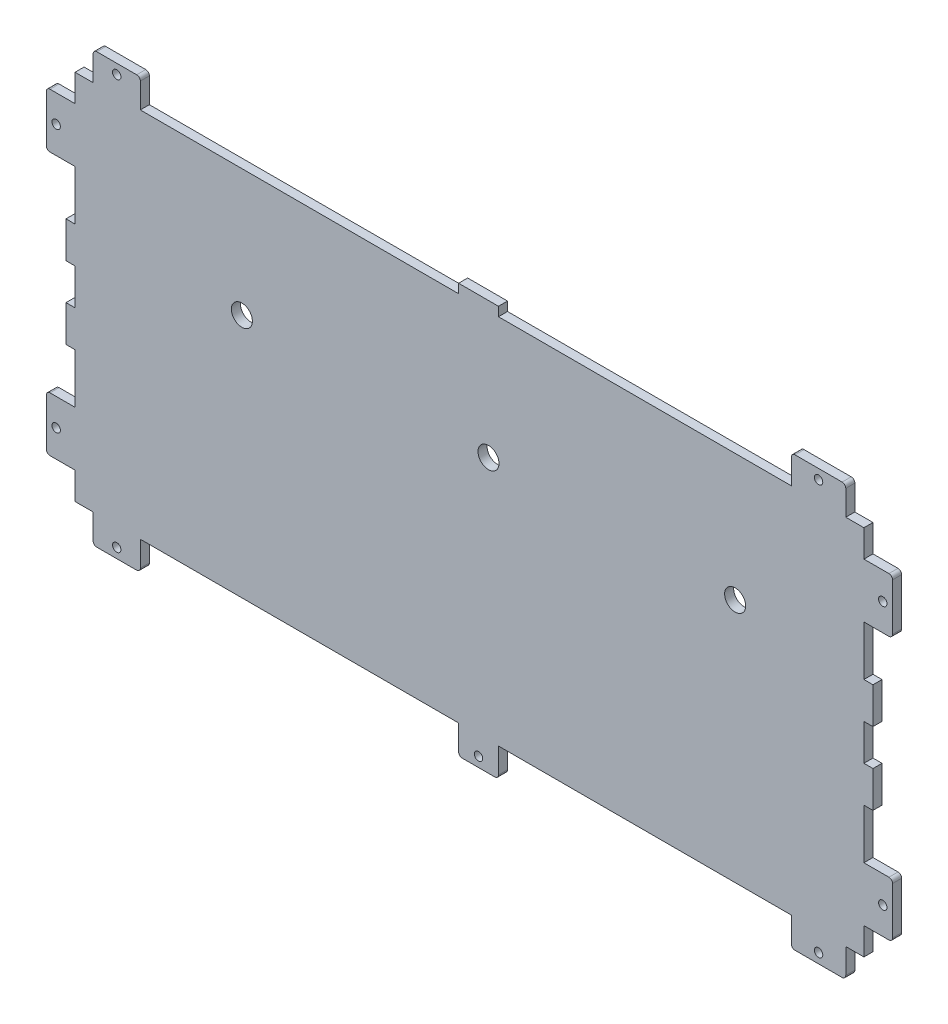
ISO-10303-21;
HEADER;
FILE_DESCRIPTION(('STEP AP214'),'2;1');
FILE_NAME('part.step','',(''),(''),'','','');
FILE_SCHEMA(('AUTOMOTIVE_DESIGN { 1 0 10303 214 1 1 1 1 }'));
ENDSEC;
DATA;
#1=APPLICATION_CONTEXT('core data for automotive mechanical design processes');
#2=APPLICATION_PROTOCOL_DEFINITION('international standard','automotive_design',2000,#1);
#3=PRODUCT_CONTEXT('',#1,'mechanical');
#4=PRODUCT('Part','Part','',(#3));
#5=PRODUCT_RELATED_PRODUCT_CATEGORY('part','',(#4));
#6=PRODUCT_DEFINITION_FORMATION('','',#4);
#7=PRODUCT_DEFINITION_CONTEXT('part definition',#1,'design');
#8=PRODUCT_DEFINITION('design','',#6,#7);
#9=PRODUCT_DEFINITION_SHAPE('','',#8);
#10=(LENGTH_UNIT() NAMED_UNIT(*) SI_UNIT(.MILLI.,.METRE.));
#11=(NAMED_UNIT(*) PLANE_ANGLE_UNIT() SI_UNIT($,.RADIAN.));
#12=(NAMED_UNIT(*) SI_UNIT($,.STERADIAN.) SOLID_ANGLE_UNIT());
#13=UNCERTAINTY_MEASURE_WITH_UNIT(LENGTH_MEASURE(1.E-05),#10,'distance_accuracy_value','');
#14=(GEOMETRIC_REPRESENTATION_CONTEXT(3) GLOBAL_UNCERTAINTY_ASSIGNED_CONTEXT((#13)) GLOBAL_UNIT_ASSIGNED_CONTEXT((#10,
#11,#12)) REPRESENTATION_CONTEXT('',''));
#15=CARTESIAN_POINT('',(0.,0.,0.));
#16=DIRECTION('',(0.,0.,1.));
#17=DIRECTION('',(1.,0.,0.));
#18=AXIS2_PLACEMENT_3D('',#15,#16,#17);
#19=CARTESIAN_POINT('',(0.,0.,3.175));
#20=DIRECTION('',(0.,0.,-1.));
#21=DIRECTION('',(-1.,0.,0.));
#22=AXIS2_PLACEMENT_3D('',#19,#20,#21);
#23=PLANE('',#22);
#24=CARTESIAN_POINT('',(141.2875,-6.604,3.175));
#25=DIRECTION('',(0.,0.,1.));
#26=DIRECTION('',(1.,0.,0.));
#27=AXIS2_PLACEMENT_3D('',#24,#25,#26);
#28=CIRCLE('',#27,1.47319999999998);
#29=CARTESIAN_POINT('',(142.7607,-6.604,3.175));
#30=VERTEX_POINT('',#29);
#31=EDGE_CURVE('E1667',#30,#30,#28,.T.);
#32=ORIENTED_EDGE('',*,*,#31,.F.);
#33=EDGE_LOOP('',(#32));
#34=FACE_BOUND('',#33,.T.);
#35=CARTESIAN_POINT('',(-6.604,111.125,3.175));
#36=DIRECTION('',(0.,0.,1.));
#37=DIRECTION('',(1.,0.,0.));
#38=AXIS2_PLACEMENT_3D('',#35,#36,#37);
#39=CIRCLE('',#38,1.47319999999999);
#40=CARTESIAN_POINT('',(-5.13080000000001,111.125,3.175));
#41=VERTEX_POINT('',#40);
#42=EDGE_CURVE('E1682',#41,#41,#39,.T.);
#43=ORIENTED_EDGE('',*,*,#42,.F.);
#44=EDGE_LOOP('',(#43));
#45=FACE_BOUND('',#44,.T.);
#46=CARTESIAN_POINT('',(14.605,136.779,3.175));
#47=DIRECTION('',(0.,0.,1.));
#48=DIRECTION('',(1.,0.,0.));
#49=AXIS2_PLACEMENT_3D('',#46,#47,#48);
#50=CIRCLE('',#49,1.47319999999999);
#51=CARTESIAN_POINT('',(16.0782,136.779,3.175));
#52=VERTEX_POINT('',#51);
#53=EDGE_CURVE('E1692',#52,#52,#50,.T.);
#54=ORIENTED_EDGE('',*,*,#53,.F.);
#55=EDGE_LOOP('',(#54));
#56=FACE_BOUND('',#55,.T.);
#57=CARTESIAN_POINT('',(144.78,85.725,3.175));
#58=DIRECTION('',(0.,0.,1.));
#59=DIRECTION('',(-1.,0.,0.));
#60=AXIS2_PLACEMENT_3D('',#57,#58,#59);
#61=CIRCLE('',#60,3.68299999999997);
#62=CARTESIAN_POINT('',(141.097,85.725,3.175));
#63=VERTEX_POINT('',#62);
#64=EDGE_CURVE('E944',#63,#63,#61,.T.);
#65=ORIENTED_EDGE('',*,*,#64,.F.);
#66=EDGE_LOOP('',(#65));
#67=FACE_BOUND('',#66,.T.);
#68=CARTESIAN_POINT('',(58.42,85.725,3.175));
#69=DIRECTION('',(0.,0.,1.));
#70=DIRECTION('',(1.,0.,0.));
#71=AXIS2_PLACEMENT_3D('',#68,#69,#70);
#72=CIRCLE('',#71,3.683);
#73=CARTESIAN_POINT('',(62.103,85.725,3.175));
#74=VERTEX_POINT('',#73);
#75=EDGE_CURVE('E710',#74,#74,#72,.T.);
#76=ORIENTED_EDGE('',*,*,#75,.F.);
#77=EDGE_LOOP('',(#76));
#78=FACE_BOUND('',#77,.T.);
#79=DIRECTION('',(1.,0.,0.));
#80=VECTOR('',#79,1.);
#81=CARTESIAN_POINT('',(6.35000000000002,-10.033,3.175));
#82=LINE('',#81,#80);
#83=CARTESIAN_POINT('',(7.62000000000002,-10.033,3.175));
#84=VERTEX_POINT('',#83);
#85=CARTESIAN_POINT('',(21.59,-10.033,3.175));
#86=VERTEX_POINT('',#85);
#87=EDGE_CURVE('E819',#84,#86,#82,.T.);
#88=ORIENTED_EDGE('',*,*,#87,.T.);
#89=CARTESIAN_POINT('',(21.59,-8.76299999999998,3.175));
#90=DIRECTION('',(0.,0.,-1.));
#91=DIRECTION('',(-1.,0.,0.));
#92=AXIS2_PLACEMENT_3D('',#89,#90,#91);
#93=CIRCLE('',#92,1.27);
#94=CARTESIAN_POINT('',(22.86,-8.76299999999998,3.175));
#95=VERTEX_POINT('',#94);
#96=EDGE_CURVE('E1048',#86,#95,#93,.F.);
#97=ORIENTED_EDGE('',*,*,#96,.T.);
#98=DIRECTION('',(0.,1.,0.));
#99=VECTOR('',#98,1.);
#100=CARTESIAN_POINT('',(22.86,0.,3.175));
#101=LINE('',#100,#99);
#102=CARTESIAN_POINT('',(22.86,0.,3.175));
#103=VERTEX_POINT('',#102);
#104=EDGE_CURVE('E817',#95,#103,#101,.T.);
#105=ORIENTED_EDGE('',*,*,#104,.T.);
#106=DIRECTION('',(1.,0.,0.));
#107=VECTOR('',#106,1.);
#108=CARTESIAN_POINT('',(0.,0.,3.175));
#109=LINE('',#108,#107);
#110=CARTESIAN_POINT('',(134.3025,0.,3.175));
#111=VERTEX_POINT('',#110);
#112=EDGE_CURVE('E677',#103,#111,#109,.T.);
#113=ORIENTED_EDGE('',*,*,#112,.T.);
#114=DIRECTION('',(0.,-1.,0.));
#115=VECTOR('',#114,1.);
#116=CARTESIAN_POINT('',(134.3025,0.,3.175));
#117=LINE('',#116,#115);
#118=CARTESIAN_POINT('',(134.3025,-8.76299999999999,3.175));
#119=VERTEX_POINT('',#118);
#120=EDGE_CURVE('E861',#111,#119,#117,.T.);
#121=ORIENTED_EDGE('',*,*,#120,.T.);
#122=CARTESIAN_POINT('',(135.5725,-8.76299999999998,3.175));
#123=DIRECTION('',(0.,0.,-1.));
#124=DIRECTION('',(-1.,0.,0.));
#125=AXIS2_PLACEMENT_3D('',#122,#123,#124);
#126=CIRCLE('',#125,1.27);
#127=CARTESIAN_POINT('',(135.5725,-10.033,3.175));
#128=VERTEX_POINT('',#127);
#129=EDGE_CURVE('E1046',#119,#128,#126,.F.);
#130=ORIENTED_EDGE('',*,*,#129,.T.);
#131=DIRECTION('',(1.,0.,0.));
#132=VECTOR('',#131,1.);
#133=CARTESIAN_POINT('',(134.3025,-10.033,3.175));
#134=LINE('',#133,#132);
#135=CARTESIAN_POINT('',(147.0025,-10.033,3.175));
#136=VERTEX_POINT('',#135);
#137=EDGE_CURVE('E864',#128,#136,#134,.T.);
#138=ORIENTED_EDGE('',*,*,#137,.T.);
#139=CARTESIAN_POINT('',(147.0025,-8.76299999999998,3.175));
#140=DIRECTION('',(0.,0.,-1.));
#141=DIRECTION('',(-1.,0.,0.));
#142=AXIS2_PLACEMENT_3D('',#139,#140,#141);
#143=CIRCLE('',#142,1.27);
#144=CARTESIAN_POINT('',(148.2725,-8.76299999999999,3.175));
#145=VERTEX_POINT('',#144);
#146=EDGE_CURVE('E1044',#136,#145,#143,.F.);
#147=ORIENTED_EDGE('',*,*,#146,.T.);
#148=DIRECTION('',(0.,1.,0.));
#149=VECTOR('',#148,1.);
#150=CARTESIAN_POINT('',(148.2725,0.,3.175));
#151=LINE('',#150,#149);
#152=CARTESIAN_POINT('',(148.2725,0.,3.175));
#153=VERTEX_POINT('',#152);
#154=EDGE_CURVE('E868',#145,#153,#151,.T.);
#155=ORIENTED_EDGE('',*,*,#154,.T.);
#156=CARTESIAN_POINT('',(250.825,0.,3.175));
#157=VERTEX_POINT('',#156);
#158=EDGE_CURVE('E664',#153,#157,#109,.T.);
#159=ORIENTED_EDGE('',*,*,#158,.T.);
#160=DIRECTION('',(0.,-1.,0.));
#161=VECTOR('',#160,1.);
#162=CARTESIAN_POINT('',(250.825,0.,3.175));
#163=LINE('',#162,#161);
#164=CARTESIAN_POINT('',(250.825,-8.76299999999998,3.175));
#165=VERTEX_POINT('',#164);
#166=EDGE_CURVE('E854',#157,#165,#163,.T.);
#167=ORIENTED_EDGE('',*,*,#166,.T.);
#168=CARTESIAN_POINT('',(252.095,-8.76299999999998,3.175));
#169=DIRECTION('',(0.,0.,-1.));
#170=DIRECTION('',(-1.,0.,0.));
#171=AXIS2_PLACEMENT_3D('',#168,#169,#170);
#172=CIRCLE('',#171,1.27);
#173=CARTESIAN_POINT('',(252.095,-10.033,3.175));
#174=VERTEX_POINT('',#173);
#175=EDGE_CURVE('E1042',#165,#174,#172,.F.);
#176=ORIENTED_EDGE('',*,*,#175,.T.);
#177=DIRECTION('',(1.,0.,0.));
#178=VECTOR('',#177,1.);
#179=CARTESIAN_POINT('',(250.825,-10.033,3.175));
#180=LINE('',#179,#178);
#181=CARTESIAN_POINT('',(268.605,-10.033,3.175));
#182=VERTEX_POINT('',#181);
#183=EDGE_CURVE('E1391',#174,#182,#180,.T.);
#184=ORIENTED_EDGE('',*,*,#183,.T.);
#185=CARTESIAN_POINT('',(268.605,-8.76299999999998,3.175));
#186=DIRECTION('',(0.,0.,-1.));
#187=DIRECTION('',(-1.,0.,0.));
#188=AXIS2_PLACEMENT_3D('',#185,#186,#187);
#189=CIRCLE('',#188,1.27);
#190=CARTESIAN_POINT('',(269.875,-8.76299999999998,3.175));
#191=VERTEX_POINT('',#190);
#192=EDGE_CURVE('E1040',#182,#191,#189,.F.);
#193=ORIENTED_EDGE('',*,*,#192,.T.);
#194=DIRECTION('',(0.,1.,0.));
#195=VECTOR('',#194,1.);
#196=CARTESIAN_POINT('',(269.875,0.,3.175));
#197=LINE('',#196,#195);
#198=CARTESIAN_POINT('',(269.875,0.,3.175));
#199=VERTEX_POINT('',#198);
#200=EDGE_CURVE('E850',#191,#199,#197,.T.);
#201=ORIENTED_EDGE('',*,*,#200,.T.);
#202=CARTESIAN_POINT('',(276.225,0.,3.175));
#203=VERTEX_POINT('',#202);
#204=EDGE_CURVE('E661',#199,#203,#109,.T.);
#205=ORIENTED_EDGE('',*,*,#204,.T.);
#206=DIRECTION('',(0.,1.,0.));
#207=VECTOR('',#206,1.);
#208=CARTESIAN_POINT('',(276.225,0.,3.175));
#209=LINE('',#208,#207);
#210=CARTESIAN_POINT('',(276.225,9.52500000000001,3.175));
#211=VERTEX_POINT('',#210);
#212=EDGE_CURVE('E923',#203,#211,#209,.T.);
#213=ORIENTED_EDGE('',*,*,#212,.T.);
#214=DIRECTION('',(1.,0.,0.));
#215=VECTOR('',#214,1.);
#216=CARTESIAN_POINT('',(276.225,9.52500000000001,3.175));
#217=LINE('',#216,#215);
#218=CARTESIAN_POINT('',(284.988,9.52500000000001,3.175));
#219=VERTEX_POINT('',#218);
#220=EDGE_CURVE('E1194',#211,#219,#217,.T.);
#221=ORIENTED_EDGE('',*,*,#220,.T.);
#222=CARTESIAN_POINT('',(284.988,10.795,3.175));
#223=DIRECTION('',(0.,0.,-1.));
#224=DIRECTION('',(-1.,0.,0.));
#225=AXIS2_PLACEMENT_3D('',#222,#223,#224);
#226=CIRCLE('',#225,1.27);
#227=CARTESIAN_POINT('',(286.258,10.795,3.175));
#228=VERTEX_POINT('',#227);
#229=EDGE_CURVE('E1038',#219,#228,#226,.F.);
#230=ORIENTED_EDGE('',*,*,#229,.T.);
#231=DIRECTION('',(0.,1.,0.));
#232=VECTOR('',#231,1.);
#233=CARTESIAN_POINT('',(286.258,9.52500000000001,3.175));
#234=LINE('',#233,#232);
#235=CARTESIAN_POINT('',(286.258,27.305,3.175));
#236=VERTEX_POINT('',#235);
#237=EDGE_CURVE('E1197',#228,#236,#234,.T.);
#238=ORIENTED_EDGE('',*,*,#237,.T.);
#239=CARTESIAN_POINT('',(284.988,27.305,3.175));
#240=DIRECTION('',(0.,0.,-1.));
#241=DIRECTION('',(-1.,0.,0.));
#242=AXIS2_PLACEMENT_3D('',#239,#240,#241);
#243=CIRCLE('',#242,1.27);
#244=CARTESIAN_POINT('',(284.988,28.575,3.175));
#245=VERTEX_POINT('',#244);
#246=EDGE_CURVE('E1036',#236,#245,#243,.F.);
#247=ORIENTED_EDGE('',*,*,#246,.T.);
#248=DIRECTION('',(-1.,0.,0.));
#249=VECTOR('',#248,1.);
#250=CARTESIAN_POINT('',(276.225,28.575,3.175));
#251=LINE('',#250,#249);
#252=CARTESIAN_POINT('',(276.225,28.575,3.175));
#253=VERTEX_POINT('',#252);
#254=EDGE_CURVE('E1201',#245,#253,#251,.T.);
#255=ORIENTED_EDGE('',*,*,#254,.T.);
#256=CARTESIAN_POINT('',(276.225,46.0375,3.175));
#257=VERTEX_POINT('',#256);
#258=EDGE_CURVE('E926',#253,#257,#209,.T.);
#259=ORIENTED_EDGE('',*,*,#258,.T.);
#260=DIRECTION('',(1.,0.,0.));
#261=VECTOR('',#260,1.);
#262=CARTESIAN_POINT('',(276.225,46.0375,3.175));
#263=LINE('',#262,#261);
#264=CARTESIAN_POINT('',(279.4,46.0375,3.175));
#265=VERTEX_POINT('',#264);
#266=EDGE_CURVE('E1143',#257,#265,#263,.T.);
#267=ORIENTED_EDGE('',*,*,#266,.T.);
#268=DIRECTION('',(0.,1.,0.));
#269=VECTOR('',#268,1.);
#270=CARTESIAN_POINT('',(279.4,46.0375,3.175));
#271=LINE('',#270,#269);
#272=CARTESIAN_POINT('',(279.4,58.7375,3.175));
#273=VERTEX_POINT('',#272);
#274=EDGE_CURVE('E1146',#265,#273,#271,.T.);
#275=ORIENTED_EDGE('',*,*,#274,.T.);
#276=DIRECTION('',(-1.,0.,0.));
#277=VECTOR('',#276,1.);
#278=CARTESIAN_POINT('',(276.225,58.7375,3.175));
#279=LINE('',#278,#277);
#280=CARTESIAN_POINT('',(276.225,58.7375,3.175));
#281=VERTEX_POINT('',#280);
#282=EDGE_CURVE('E1149',#273,#281,#279,.T.);
#283=ORIENTED_EDGE('',*,*,#282,.T.);
#284=CARTESIAN_POINT('',(276.225,71.4375,3.175));
#285=VERTEX_POINT('',#284);
#286=EDGE_CURVE('E963',#281,#285,#209,.T.);
#287=ORIENTED_EDGE('',*,*,#286,.T.);
#288=DIRECTION('',(1.,0.,0.));
#289=VECTOR('',#288,1.);
#290=CARTESIAN_POINT('',(276.225,71.4375,3.175));
#291=LINE('',#290,#289);
#292=CARTESIAN_POINT('',(279.4,71.4375,3.175));
#293=VERTEX_POINT('',#292);
#294=EDGE_CURVE('E1168',#285,#293,#291,.T.);
#295=ORIENTED_EDGE('',*,*,#294,.T.);
#296=DIRECTION('',(0.,1.,0.));
#297=VECTOR('',#296,1.);
#298=CARTESIAN_POINT('',(279.4,84.1375,3.175));
#299=LINE('',#298,#297);
#300=CARTESIAN_POINT('',(279.4,84.1375,3.175));
#301=VERTEX_POINT('',#300);
#302=EDGE_CURVE('E1170',#293,#301,#299,.T.);
#303=ORIENTED_EDGE('',*,*,#302,.T.);
#304=DIRECTION('',(-1.,0.,0.));
#305=VECTOR('',#304,1.);
#306=CARTESIAN_POINT('',(276.225,84.1375,3.175));
#307=LINE('',#306,#305);
#308=CARTESIAN_POINT('',(276.225,84.1375,3.175));
#309=VERTEX_POINT('',#308);
#310=EDGE_CURVE('E1173',#301,#309,#307,.T.);
#311=ORIENTED_EDGE('',*,*,#310,.T.);
#312=CARTESIAN_POINT('',(276.225,101.6,3.175));
#313=VERTEX_POINT('',#312);
#314=EDGE_CURVE('E929',#309,#313,#209,.T.);
#315=ORIENTED_EDGE('',*,*,#314,.T.);
#316=DIRECTION('',(1.,0.,0.));
#317=VECTOR('',#316,1.);
#318=CARTESIAN_POINT('',(276.225,101.6,3.175));
#319=LINE('',#318,#317);
#320=CARTESIAN_POINT('',(284.988,101.6,3.175));
#321=VERTEX_POINT('',#320);
#322=EDGE_CURVE('E1215',#313,#321,#319,.T.);
#323=ORIENTED_EDGE('',*,*,#322,.T.);
#324=CARTESIAN_POINT('',(284.988,102.87,3.175));
#325=DIRECTION('',(0.,0.,-1.));
#326=DIRECTION('',(-1.,0.,0.));
#327=AXIS2_PLACEMENT_3D('',#324,#325,#326);
#328=CIRCLE('',#327,1.27);
#329=CARTESIAN_POINT('',(286.258,102.87,3.175));
#330=VERTEX_POINT('',#329);
#331=EDGE_CURVE('E1034',#321,#330,#328,.F.);
#332=ORIENTED_EDGE('',*,*,#331,.T.);
#333=DIRECTION('',(0.,1.,0.));
#334=VECTOR('',#333,1.);
#335=CARTESIAN_POINT('',(286.258,120.65,3.175));
#336=LINE('',#335,#334);
#337=CARTESIAN_POINT('',(286.258,119.38,3.175));
#338=VERTEX_POINT('',#337);
#339=EDGE_CURVE('E1213',#330,#338,#336,.T.);
#340=ORIENTED_EDGE('',*,*,#339,.T.);
#341=CARTESIAN_POINT('',(284.988,119.38,3.175));
#342=DIRECTION('',(0.,0.,-1.));
#343=DIRECTION('',(-1.,0.,0.));
#344=AXIS2_PLACEMENT_3D('',#341,#342,#343);
#345=CIRCLE('',#344,1.27);
#346=CARTESIAN_POINT('',(284.988,120.65,3.175));
#347=VERTEX_POINT('',#346);
#348=EDGE_CURVE('E1032',#338,#347,#345,.F.);
#349=ORIENTED_EDGE('',*,*,#348,.T.);
#350=DIRECTION('',(-1.,0.,0.));
#351=VECTOR('',#350,1.);
#352=CARTESIAN_POINT('',(276.225,120.65,3.175));
#353=LINE('',#352,#351);
#354=CARTESIAN_POINT('',(276.225,120.65,3.175));
#355=VERTEX_POINT('',#354);
#356=EDGE_CURVE('E934',#347,#355,#353,.T.);
#357=ORIENTED_EDGE('',*,*,#356,.T.);
#358=CARTESIAN_POINT('',(276.225,130.175,3.175));
#359=VERTEX_POINT('',#358);
#360=EDGE_CURVE('E927',#355,#359,#209,.T.);
#361=ORIENTED_EDGE('',*,*,#360,.T.);
#362=DIRECTION('',(-1.,0.,0.));
#363=VECTOR('',#362,1.);
#364=CARTESIAN_POINT('',(0.,130.175,3.175));
#365=LINE('',#364,#363);
#366=CARTESIAN_POINT('',(269.875,130.175,3.175));
#367=VERTEX_POINT('',#366);
#368=EDGE_CURVE('E1234',#359,#367,#365,.T.);
#369=ORIENTED_EDGE('',*,*,#368,.T.);
#370=DIRECTION('',(0.,1.,0.));
#371=VECTOR('',#370,1.);
#372=CARTESIAN_POINT('',(269.875,130.175,3.175));
#373=LINE('',#372,#371);
#374=CARTESIAN_POINT('',(269.875,138.938,3.175));
#375=VERTEX_POINT('',#374);
#376=EDGE_CURVE('E590',#367,#375,#373,.T.);
#377=ORIENTED_EDGE('',*,*,#376,.T.);
#378=CARTESIAN_POINT('',(268.605,138.938,3.175));
#379=DIRECTION('',(0.,0.,-1.));
#380=DIRECTION('',(-1.,0.,0.));
#381=AXIS2_PLACEMENT_3D('',#378,#379,#380);
#382=CIRCLE('',#381,1.27);
#383=CARTESIAN_POINT('',(268.605,140.208,3.175));
#384=VERTEX_POINT('',#383);
#385=EDGE_CURVE('E1030',#375,#384,#382,.F.);
#386=ORIENTED_EDGE('',*,*,#385,.T.);
#387=DIRECTION('',(-1.,0.,0.));
#388=VECTOR('',#387,1.);
#389=CARTESIAN_POINT('',(250.825,140.208,3.175));
#390=LINE('',#389,#388);
#391=CARTESIAN_POINT('',(252.095,140.208,3.175));
#392=VERTEX_POINT('',#391);
#393=EDGE_CURVE('E594',#384,#392,#390,.T.);
#394=ORIENTED_EDGE('',*,*,#393,.T.);
#395=CARTESIAN_POINT('',(252.095,138.938,3.175));
#396=DIRECTION('',(0.,0.,-1.));
#397=DIRECTION('',(-1.,0.,0.));
#398=AXIS2_PLACEMENT_3D('',#395,#396,#397);
#399=CIRCLE('',#398,1.27);
#400=CARTESIAN_POINT('',(250.825,138.938,3.175));
#401=VERTEX_POINT('',#400);
#402=EDGE_CURVE('E1028',#392,#401,#399,.F.);
#403=ORIENTED_EDGE('',*,*,#402,.T.);
#404=DIRECTION('',(0.,-1.,0.));
#405=VECTOR('',#404,1.);
#406=CARTESIAN_POINT('',(250.825,130.175,3.175));
#407=LINE('',#406,#405);
#408=CARTESIAN_POINT('',(250.825,130.175,3.175));
#409=VERTEX_POINT('',#408);
#410=EDGE_CURVE('E588',#401,#409,#407,.T.);
#411=ORIENTED_EDGE('',*,*,#410,.T.);
#412=CARTESIAN_POINT('',(148.2725,130.175,3.175));
#413=VERTEX_POINT('',#412);
#414=EDGE_CURVE('E642',#409,#413,#365,.T.);
#415=ORIENTED_EDGE('',*,*,#414,.T.);
#416=DIRECTION('',(0.,1.,0.));
#417=VECTOR('',#416,1.);
#418=CARTESIAN_POINT('',(148.2725,130.175,3.175));
#419=LINE('',#418,#417);
#420=CARTESIAN_POINT('',(148.2725,133.35,3.175));
#421=VERTEX_POINT('',#420);
#422=EDGE_CURVE('E565',#413,#421,#419,.T.);
#423=ORIENTED_EDGE('',*,*,#422,.T.);
#424=DIRECTION('',(-1.,0.,0.));
#425=VECTOR('',#424,1.);
#426=CARTESIAN_POINT('',(134.3025,133.35,3.175));
#427=LINE('',#426,#425);
#428=CARTESIAN_POINT('',(134.3025,133.35,3.175));
#429=VERTEX_POINT('',#428);
#430=EDGE_CURVE('E568',#421,#429,#427,.T.);
#431=ORIENTED_EDGE('',*,*,#430,.T.);
#432=DIRECTION('',(0.,-1.,0.));
#433=VECTOR('',#432,1.);
#434=CARTESIAN_POINT('',(134.3025,130.175,3.175));
#435=LINE('',#434,#433);
#436=CARTESIAN_POINT('',(134.3025,130.175,3.175));
#437=VERTEX_POINT('',#436);
#438=EDGE_CURVE('E562',#429,#437,#435,.T.);
#439=ORIENTED_EDGE('',*,*,#438,.T.);
#440=CARTESIAN_POINT('',(22.86,130.175,3.175));
#441=VERTEX_POINT('',#440);
#442=EDGE_CURVE('E1230',#437,#441,#365,.T.);
#443=ORIENTED_EDGE('',*,*,#442,.T.);
#444=DIRECTION('',(0.,1.,0.));
#445=VECTOR('',#444,1.);
#446=CARTESIAN_POINT('',(22.86,130.175,3.175));
#447=LINE('',#446,#445);
#448=CARTESIAN_POINT('',(22.86,138.938,3.175));
#449=VERTEX_POINT('',#448);
#450=EDGE_CURVE('E613',#441,#449,#447,.T.);
#451=ORIENTED_EDGE('',*,*,#450,.T.);
#452=CARTESIAN_POINT('',(21.59,138.938,3.175));
#453=DIRECTION('',(0.,0.,-1.));
#454=DIRECTION('',(-1.,0.,0.));
#455=AXIS2_PLACEMENT_3D('',#452,#453,#454);
#456=CIRCLE('',#455,1.27);
#457=CARTESIAN_POINT('',(21.59,140.208,3.175));
#458=VERTEX_POINT('',#457);
#459=EDGE_CURVE('E1026',#449,#458,#456,.F.);
#460=ORIENTED_EDGE('',*,*,#459,.T.);
#461=DIRECTION('',(-1.,0.,0.));
#462=VECTOR('',#461,1.);
#463=CARTESIAN_POINT('',(6.35,140.208,3.175));
#464=LINE('',#463,#462);
#465=CARTESIAN_POINT('',(7.62,140.208,3.175));
#466=VERTEX_POINT('',#465);
#467=EDGE_CURVE('E610',#458,#466,#464,.T.);
#468=ORIENTED_EDGE('',*,*,#467,.T.);
#469=CARTESIAN_POINT('',(7.62,138.938,3.175));
#470=DIRECTION('',(0.,0.,-1.));
#471=DIRECTION('',(-1.,0.,0.));
#472=AXIS2_PLACEMENT_3D('',#469,#470,#471);
#473=CIRCLE('',#472,1.27);
#474=CARTESIAN_POINT('',(6.35,138.938,3.175));
#475=VERTEX_POINT('',#474);
#476=EDGE_CURVE('E48',#466,#475,#473,.F.);
#477=ORIENTED_EDGE('',*,*,#476,.T.);
#478=DIRECTION('',(0.,-1.,0.));
#479=VECTOR('',#478,1.);
#480=CARTESIAN_POINT('',(6.35000000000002,130.175,3.175));
#481=LINE('',#480,#479);
#482=CARTESIAN_POINT('',(6.35000000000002,130.175,3.175));
#483=VERTEX_POINT('',#482);
#484=EDGE_CURVE('E616',#475,#483,#481,.T.);
#485=ORIENTED_EDGE('',*,*,#484,.T.);
#486=CARTESIAN_POINT('',(0.,130.175,3.175));
#487=VERTEX_POINT('',#486);
#488=EDGE_CURVE('E832',#483,#487,#365,.T.);
#489=ORIENTED_EDGE('',*,*,#488,.T.);
#490=DIRECTION('',(0.,-1.,0.));
#491=VECTOR('',#490,1.);
#492=CARTESIAN_POINT('',(0.,0.,3.175));
#493=LINE('',#492,#491);
#494=CARTESIAN_POINT('',(0.,120.65,3.175));
#495=VERTEX_POINT('',#494);
#496=EDGE_CURVE('E665',#487,#495,#493,.T.);
#497=ORIENTED_EDGE('',*,*,#496,.T.);
#498=DIRECTION('',(-1.,0.,0.));
#499=VECTOR('',#498,1.);
#500=CARTESIAN_POINT('',(0.,120.65,3.175));
#501=LINE('',#500,#499);
#502=CARTESIAN_POINT('',(-8.76300000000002,120.65,3.175));
#503=VERTEX_POINT('',#502);
#504=EDGE_CURVE('E784',#495,#503,#501,.T.);
#505=ORIENTED_EDGE('',*,*,#504,.T.);
#506=CARTESIAN_POINT('',(-8.76300000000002,119.38,3.175));
#507=DIRECTION('',(0.,0.,-1.));
#508=DIRECTION('',(-1.,0.,0.));
#509=AXIS2_PLACEMENT_3D('',#506,#507,#508);
#510=CIRCLE('',#509,1.27);
#511=CARTESIAN_POINT('',(-10.033,119.38,3.175));
#512=VERTEX_POINT('',#511);
#513=EDGE_CURVE('E1023',#503,#512,#510,.F.);
#514=ORIENTED_EDGE('',*,*,#513,.T.);
#515=DIRECTION('',(0.,-1.,0.));
#516=VECTOR('',#515,1.);
#517=CARTESIAN_POINT('',(-10.033,120.65,3.175));
#518=LINE('',#517,#516);
#519=CARTESIAN_POINT('',(-10.0330000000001,102.87,3.175));
#520=VERTEX_POINT('',#519);
#521=EDGE_CURVE('E793',#512,#520,#518,.T.);
#522=ORIENTED_EDGE('',*,*,#521,.T.);
#523=CARTESIAN_POINT('',(-8.76300000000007,102.87,3.175));
#524=DIRECTION('',(0.,0.,-1.));
#525=DIRECTION('',(-1.,0.,0.));
#526=AXIS2_PLACEMENT_3D('',#523,#524,#525);
#527=CIRCLE('',#526,1.27);
#528=CARTESIAN_POINT('',(-8.76300000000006,101.6,3.175));
#529=VERTEX_POINT('',#528);
#530=EDGE_CURVE('E1016',#520,#529,#527,.F.);
#531=ORIENTED_EDGE('',*,*,#530,.T.);
#532=DIRECTION('',(1.,0.,0.));
#533=VECTOR('',#532,1.);
#534=CARTESIAN_POINT('',(0.,101.6,3.175));
#535=LINE('',#534,#533);
#536=CARTESIAN_POINT('',(0.,101.6,3.175));
#537=VERTEX_POINT('',#536);
#538=EDGE_CURVE('E781',#529,#537,#535,.T.);
#539=ORIENTED_EDGE('',*,*,#538,.T.);
#540=CARTESIAN_POINT('',(0.,84.1375,3.175));
#541=VERTEX_POINT('',#540);
#542=EDGE_CURVE('E701',#537,#541,#493,.T.);
#543=ORIENTED_EDGE('',*,*,#542,.T.);
#544=DIRECTION('',(-1.,0.,0.));
#545=VECTOR('',#544,1.);
#546=CARTESIAN_POINT('',(0.,84.1375,3.175));
#547=LINE('',#546,#545);
#548=CARTESIAN_POINT('',(-3.17500000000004,84.1375,3.175));
#549=VERTEX_POINT('',#548);
#550=EDGE_CURVE('E722',#541,#549,#547,.T.);
#551=ORIENTED_EDGE('',*,*,#550,.T.);
#552=DIRECTION('',(0.,-1.,0.));
#553=VECTOR('',#552,1.);
#554=CARTESIAN_POINT('',(-3.17500000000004,84.1375,3.175));
#555=LINE('',#554,#553);
#556=CARTESIAN_POINT('',(-3.17500000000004,71.4375,3.175));
#557=VERTEX_POINT('',#556);
#558=EDGE_CURVE('E725',#549,#557,#555,.T.);
#559=ORIENTED_EDGE('',*,*,#558,.T.);
#560=DIRECTION('',(1.,0.,0.));
#561=VECTOR('',#560,1.);
#562=CARTESIAN_POINT('',(0.,71.4375,3.175));
#563=LINE('',#562,#561);
#564=CARTESIAN_POINT('',(0.,71.4375,3.175));
#565=VERTEX_POINT('',#564);
#566=EDGE_CURVE('E732',#557,#565,#563,.T.);
#567=ORIENTED_EDGE('',*,*,#566,.T.);
#568=CARTESIAN_POINT('',(0.,58.7374999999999,3.175));
#569=VERTEX_POINT('',#568);
#570=EDGE_CURVE('E527',#565,#569,#493,.T.);
#571=ORIENTED_EDGE('',*,*,#570,.T.);
#572=DIRECTION('',(-1.,0.,0.));
#573=VECTOR('',#572,1.);
#574=CARTESIAN_POINT('',(0.,58.7374999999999,3.175));
#575=LINE('',#574,#573);
#576=CARTESIAN_POINT('',(-3.17500000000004,58.7375,3.175));
#577=VERTEX_POINT('',#576);
#578=EDGE_CURVE('E518',#569,#577,#575,.T.);
#579=ORIENTED_EDGE('',*,*,#578,.T.);
#580=DIRECTION('',(0.,-1.,0.));
#581=VECTOR('',#580,1.);
#582=CARTESIAN_POINT('',(-3.17500000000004,46.0375,3.175));
#583=LINE('',#582,#581);
#584=CARTESIAN_POINT('',(-3.17500000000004,46.0375,3.175));
#585=VERTEX_POINT('',#584);
#586=EDGE_CURVE('E524',#577,#585,#583,.T.);
#587=ORIENTED_EDGE('',*,*,#586,.T.);
#588=DIRECTION('',(1.,0.,0.));
#589=VECTOR('',#588,1.);
#590=CARTESIAN_POINT('',(0.,46.0375,3.175));
#591=LINE('',#590,#589);
#592=CARTESIAN_POINT('',(0.,46.0375,3.175));
#593=VERTEX_POINT('',#592);
#594=EDGE_CURVE('E545',#585,#593,#591,.T.);
#595=ORIENTED_EDGE('',*,*,#594,.T.);
#596=CARTESIAN_POINT('',(0.,28.575,3.175));
#597=VERTEX_POINT('',#596);
#598=EDGE_CURVE('E712',#593,#597,#493,.T.);
#599=ORIENTED_EDGE('',*,*,#598,.T.);
#600=DIRECTION('',(-1.,0.,0.));
#601=VECTOR('',#600,1.);
#602=CARTESIAN_POINT('',(0.,28.575,3.175));
#603=LINE('',#602,#601);
#604=CARTESIAN_POINT('',(-8.76300000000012,28.575,3.175));
#605=VERTEX_POINT('',#604);
#606=EDGE_CURVE('E762',#597,#605,#603,.T.);
#607=ORIENTED_EDGE('',*,*,#606,.T.);
#608=CARTESIAN_POINT('',(-8.76300000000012,27.305,3.175));
#609=DIRECTION('',(0.,0.,-1.));
#610=DIRECTION('',(-1.,0.,0.));
#611=AXIS2_PLACEMENT_3D('',#608,#609,#610);
#612=CIRCLE('',#611,1.27);
#613=CARTESIAN_POINT('',(-10.0330000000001,27.305,3.175));
#614=VERTEX_POINT('',#613);
#615=EDGE_CURVE('E1013',#605,#614,#612,.F.);
#616=ORIENTED_EDGE('',*,*,#615,.T.);
#617=DIRECTION('',(0.,-1.,0.));
#618=VECTOR('',#617,1.);
#619=CARTESIAN_POINT('',(-10.033,9.52499999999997,3.175));
#620=LINE('',#619,#618);
#621=CARTESIAN_POINT('',(-10.033,10.795,3.175));
#622=VERTEX_POINT('',#621);
#623=EDGE_CURVE('E771',#614,#622,#620,.T.);
#624=ORIENTED_EDGE('',*,*,#623,.T.);
#625=CARTESIAN_POINT('',(-8.76300000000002,10.795,3.175));
#626=DIRECTION('',(0.,0.,-1.));
#627=DIRECTION('',(-1.,0.,0.));
#628=AXIS2_PLACEMENT_3D('',#625,#626,#627);
#629=CIRCLE('',#628,1.27);
#630=CARTESIAN_POINT('',(-8.76300000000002,9.52499999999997,3.175));
#631=VERTEX_POINT('',#630);
#632=EDGE_CURVE('E1010',#622,#631,#629,.F.);
#633=ORIENTED_EDGE('',*,*,#632,.T.);
#634=DIRECTION('',(1.,0.,0.));
#635=VECTOR('',#634,1.);
#636=CARTESIAN_POINT('',(0.,9.52500000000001,3.175));
#637=LINE('',#636,#635);
#638=CARTESIAN_POINT('',(0.,9.52499999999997,3.175));
#639=VERTEX_POINT('',#638);
#640=EDGE_CURVE('E759',#631,#639,#637,.T.);
#641=ORIENTED_EDGE('',*,*,#640,.T.);
#642=CARTESIAN_POINT('',(0.,0.,3.175));
#643=VERTEX_POINT('',#642);
#644=EDGE_CURVE('E660',#639,#643,#493,.T.);
#645=ORIENTED_EDGE('',*,*,#644,.T.);
#646=CARTESIAN_POINT('',(6.35000000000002,0.,3.175));
#647=VERTEX_POINT('',#646);
#648=EDGE_CURVE('E681',#643,#647,#109,.T.);
#649=ORIENTED_EDGE('',*,*,#648,.T.);
#650=DIRECTION('',(0.,-1.,0.));
#651=VECTOR('',#650,1.);
#652=CARTESIAN_POINT('',(6.35000000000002,0.,3.175));
#653=LINE('',#652,#651);
#654=CARTESIAN_POINT('',(6.35000000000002,-8.76299999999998,3.175));
#655=VERTEX_POINT('',#654);
#656=EDGE_CURVE('E813',#647,#655,#653,.T.);
#657=ORIENTED_EDGE('',*,*,#656,.T.);
#658=CARTESIAN_POINT('',(7.62000000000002,-8.76299999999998,3.175));
#659=DIRECTION('',(0.,0.,-1.));
#660=DIRECTION('',(-1.,0.,0.));
#661=AXIS2_PLACEMENT_3D('',#658,#659,#660);
#662=CIRCLE('',#661,1.27);
#663=EDGE_CURVE('E1014',#655,#84,#662,.F.);
#664=ORIENTED_EDGE('',*,*,#663,.T.);
#665=EDGE_LOOP('',(#88,#97,#105,#113,#121,#130,#138,#147,#155,#159,#167,#176,#184,#193,#201,
#205,#213,#221,#230,#238,#247,#255,#259,#267,#275,#283,#287,#295,#303,#311,#315,#323,#332,#340,
#349,#357,#361,#369,#377,#386,#394,#403,#411,#415,#423,#431,#439,#443,#451,#460,#468,#477,#485,
#489,#497,#505,#514,#522,#531,#539,#543,#551,#559,#567,#571,#579,#587,#595,#599,#607,#616,#624,
#633,#641,#645,#649,#657,#664));
#666=FACE_BOUND('',#665,.T.);
#667=CARTESIAN_POINT('',(231.14,85.725,3.175));
#668=DIRECTION('',(0.,0.,1.));
#669=DIRECTION('',(1.,0.,0.));
#670=AXIS2_PLACEMENT_3D('',#667,#668,#669);
#671=CIRCLE('',#670,3.68299999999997);
#672=CARTESIAN_POINT('',(234.823,85.725,3.175));
#673=VERTEX_POINT('',#672);
#674=EDGE_CURVE('E1736',#673,#673,#671,.T.);
#675=ORIENTED_EDGE('',*,*,#674,.F.);
#676=EDGE_LOOP('',(#675));
#677=FACE_BOUND('',#676,.T.);
#678=CARTESIAN_POINT('',(-6.6040000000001,19.05,3.175));
#679=DIRECTION('',(0.,0.,1.));
#680=DIRECTION('',(1.,0.,0.));
#681=AXIS2_PLACEMENT_3D('',#678,#679,#680);
#682=CIRCLE('',#681,1.47319999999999);
#683=CARTESIAN_POINT('',(-5.13080000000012,19.05,3.175));
#684=VERTEX_POINT('',#683);
#685=EDGE_CURVE('E1699',#684,#684,#682,.T.);
#686=ORIENTED_EDGE('',*,*,#685,.F.);
#687=EDGE_LOOP('',(#686));
#688=FACE_BOUND('',#687,.T.);
#689=CARTESIAN_POINT('',(282.829,19.05,3.175));
#690=DIRECTION('',(0.,0.,1.));
#691=DIRECTION('',(1.,0.,0.));
#692=AXIS2_PLACEMENT_3D('',#689,#690,#691);
#693=CIRCLE('',#692,1.47320000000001);
#694=CARTESIAN_POINT('',(284.3022,19.05,3.175));
#695=VERTEX_POINT('',#694);
#696=EDGE_CURVE('E1696',#695,#695,#693,.T.);
#697=ORIENTED_EDGE('',*,*,#696,.F.);
#698=EDGE_LOOP('',(#697));
#699=FACE_BOUND('',#698,.T.);
#700=CARTESIAN_POINT('',(260.35,136.779,3.175));
#701=DIRECTION('',(0.,0.,1.));
#702=DIRECTION('',(1.,0.,0.));
#703=AXIS2_PLACEMENT_3D('',#700,#701,#702);
#704=CIRCLE('',#703,1.47320000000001);
#705=CARTESIAN_POINT('',(261.8232,136.779,3.175));
#706=VERTEX_POINT('',#705);
#707=EDGE_CURVE('E1686',#706,#706,#704,.T.);
#708=ORIENTED_EDGE('',*,*,#707,.F.);
#709=EDGE_LOOP('',(#708));
#710=FACE_BOUND('',#709,.T.);
#711=CARTESIAN_POINT('',(282.829,111.125,3.175));
#712=DIRECTION('',(0.,0.,1.));
#713=DIRECTION('',(1.,0.,0.));
#714=AXIS2_PLACEMENT_3D('',#711,#712,#713);
#715=CIRCLE('',#714,1.47320000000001);
#716=CARTESIAN_POINT('',(284.3022,111.125,3.175));
#717=VERTEX_POINT('',#716);
#718=EDGE_CURVE('E1676',#717,#717,#715,.T.);
#719=ORIENTED_EDGE('',*,*,#718,.F.);
#720=EDGE_LOOP('',(#719));
#721=FACE_BOUND('',#720,.T.);
#722=CARTESIAN_POINT('',(260.35,-6.604,3.175));
#723=DIRECTION('',(0.,0.,1.));
#724=DIRECTION('',(1.,0.,0.));
#725=AXIS2_PLACEMENT_3D('',#722,#723,#724);
#726=CIRCLE('',#725,1.47320000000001);
#727=CARTESIAN_POINT('',(261.8232,-6.604,3.175));
#728=VERTEX_POINT('',#727);
#729=EDGE_CURVE('E1672',#728,#728,#726,.T.);
#730=ORIENTED_EDGE('',*,*,#729,.F.);
#731=EDGE_LOOP('',(#730));
#732=FACE_BOUND('',#731,.T.);
#733=CARTESIAN_POINT('',(14.605,-6.604,3.175));
#734=DIRECTION('',(0.,0.,1.));
#735=DIRECTION('',(1.,0.,0.));
#736=AXIS2_PLACEMENT_3D('',#733,#734,#735);
#737=CIRCLE('',#736,1.47319999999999);
#738=CARTESIAN_POINT('',(16.0782,-6.604,3.175));
#739=VERTEX_POINT('',#738);
#740=EDGE_CURVE('E1664',#739,#739,#737,.T.);
#741=ORIENTED_EDGE('',*,*,#740,.F.);
#742=EDGE_LOOP('',(#741));
#743=FACE_BOUND('',#742,.T.);
#744=ADVANCED_FACE('F33',(#34,#45,#56,#67,#78,#666,#677,#688,#699,#710,#721,#732,#743),#23,.F.);
#745=CARTESIAN_POINT('',(0.,0.,3.175));
#746=DIRECTION('',(1.,0.,0.));
#747=DIRECTION('',(0.,0.,-1.));
#748=AXIS2_PLACEMENT_3D('',#745,#746,#747);
#749=PLANE('',#748);
#750=DIRECTION('',(0.,0.,-1.));
#751=VECTOR('',#750,1.);
#752=CARTESIAN_POINT('',(0.,58.7374999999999,3.175));
#753=LINE('',#752,#751);
#754=CARTESIAN_POINT('',(0.,58.7374999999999,0.));
#755=VERTEX_POINT('',#754);
#756=EDGE_CURVE('E539',#569,#755,#753,.T.);
#757=ORIENTED_EDGE('',*,*,#756,.F.);
#758=ORIENTED_EDGE('',*,*,#570,.F.);
#759=DIRECTION('',(0.,0.,-1.));
#760=VECTOR('',#759,1.);
#761=CARTESIAN_POINT('',(0.,71.4375,3.175));
#762=LINE('',#761,#760);
#763=CARTESIAN_POINT('',(0.,71.4375,0.));
#764=VERTEX_POINT('',#763);
#765=EDGE_CURVE('E731',#565,#764,#762,.T.);
#766=ORIENTED_EDGE('',*,*,#765,.T.);
#767=DIRECTION('',(0.,-1.,0.));
#768=VECTOR('',#767,1.);
#769=CARTESIAN_POINT('',(0.,0.,0.));
#770=LINE('',#769,#768);
#771=EDGE_CURVE('E706',#764,#755,#770,.T.);
#772=ORIENTED_EDGE('',*,*,#771,.T.);
#773=EDGE_LOOP('',(#757,#758,#766,#772));
#774=FACE_BOUND('',#773,.T.);
#775=ADVANCED_FACE('F1503',(#774),#749,.F.);
#776=DIRECTION('',(0.,0.,-1.));
#777=VECTOR('',#776,1.);
#778=CARTESIAN_POINT('',(0.,46.0375,3.175));
#779=LINE('',#778,#777);
#780=CARTESIAN_POINT('',(0.,46.0375,0.));
#781=VERTEX_POINT('',#780);
#782=EDGE_CURVE('E547',#593,#781,#779,.T.);
#783=ORIENTED_EDGE('',*,*,#782,.T.);
#784=CARTESIAN_POINT('',(0.,28.575,0.));
#785=VERTEX_POINT('',#784);
#786=EDGE_CURVE('E709',#781,#785,#770,.T.);
#787=ORIENTED_EDGE('',*,*,#786,.T.);
#788=DIRECTION('',(0.,0.,-1.));
#789=VECTOR('',#788,1.);
#790=CARTESIAN_POINT('',(0.,28.575,3.175));
#791=LINE('',#790,#789);
#792=EDGE_CURVE('E719',#597,#785,#791,.T.);
#793=ORIENTED_EDGE('',*,*,#792,.F.);
#794=ORIENTED_EDGE('',*,*,#598,.F.);
#795=EDGE_LOOP('',(#783,#787,#793,#794));
#796=FACE_BOUND('',#795,.T.);
#797=ADVANCED_FACE('F1509',(#796),#749,.F.);
#798=CARTESIAN_POINT('',(0.,130.175,3.175));
#799=DIRECTION('',(0.,-1.,0.));
#800=DIRECTION('',(0.,0.,-1.));
#801=AXIS2_PLACEMENT_3D('',#798,#799,#800);
#802=PLANE('',#801);
#803=DIRECTION('',(0.,0.,-1.));
#804=VECTOR('',#803,1.);
#805=CARTESIAN_POINT('',(134.3025,130.175,3.175));
#806=LINE('',#805,#804);
#807=CARTESIAN_POINT('',(134.3025,130.175,0.));
#808=VERTEX_POINT('',#807);
#809=EDGE_CURVE('E584',#437,#808,#806,.T.);
#810=ORIENTED_EDGE('',*,*,#809,.T.);
#811=DIRECTION('',(-1.,0.,0.));
#812=VECTOR('',#811,1.);
#813=CARTESIAN_POINT('',(0.,130.175,0.));
#814=LINE('',#813,#812);
#815=CARTESIAN_POINT('',(22.86,130.175,0.));
#816=VERTEX_POINT('',#815);
#817=EDGE_CURVE('E641',#808,#816,#814,.T.);
#818=ORIENTED_EDGE('',*,*,#817,.T.);
#819=DIRECTION('',(0.,0.,-1.));
#820=VECTOR('',#819,1.);
#821=CARTESIAN_POINT('',(22.86,130.175,3.175));
#822=LINE('',#821,#820);
#823=EDGE_CURVE('E612',#441,#816,#822,.T.);
#824=ORIENTED_EDGE('',*,*,#823,.F.);
#825=ORIENTED_EDGE('',*,*,#442,.F.);
#826=EDGE_LOOP('',(#810,#818,#824,#825));
#827=FACE_BOUND('',#826,.T.);
#828=ADVANCED_FACE('F1298',(#827),#802,.F.);
#829=DIRECTION('',(0.,0.,-1.));
#830=VECTOR('',#829,1.);
#831=CARTESIAN_POINT('',(148.2725,130.175,3.175));
#832=LINE('',#831,#830);
#833=CARTESIAN_POINT('',(148.2725,130.175,0.));
#834=VERTEX_POINT('',#833);
#835=EDGE_CURVE('E581',#413,#834,#832,.T.);
#836=ORIENTED_EDGE('',*,*,#835,.F.);
#837=ORIENTED_EDGE('',*,*,#414,.F.);
#838=DIRECTION('',(0.,0.,-1.));
#839=VECTOR('',#838,1.);
#840=CARTESIAN_POINT('',(250.825,130.175,3.175));
#841=LINE('',#840,#839);
#842=CARTESIAN_POINT('',(250.825,130.175,0.));
#843=VERTEX_POINT('',#842);
#844=EDGE_CURVE('E606',#409,#843,#841,.T.);
#845=ORIENTED_EDGE('',*,*,#844,.T.);
#846=EDGE_CURVE('E637',#843,#834,#814,.T.);
#847=ORIENTED_EDGE('',*,*,#846,.T.);
#848=EDGE_LOOP('',(#836,#837,#845,#847));
#849=FACE_BOUND('',#848,.T.);
#850=ADVANCED_FACE('F1281',(#849),#802,.F.);
#851=DIRECTION('',(0.,0.,-1.));
#852=VECTOR('',#851,1.);
#853=CARTESIAN_POINT('',(269.875,130.175,3.175));
#854=LINE('',#853,#852);
#855=CARTESIAN_POINT('',(269.875,130.175,0.));
#856=VERTEX_POINT('',#855);
#857=EDGE_CURVE('E597',#367,#856,#854,.T.);
#858=ORIENTED_EDGE('',*,*,#857,.F.);
#859=ORIENTED_EDGE('',*,*,#368,.F.);
#860=DIRECTION('',(0.,0.,-1.));
#861=VECTOR('',#860,1.);
#862=CARTESIAN_POINT('',(276.225,130.175,3.175));
#863=LINE('',#862,#861);
#864=CARTESIAN_POINT('',(276.225,130.175,0.));
#865=VERTEX_POINT('',#864);
#866=EDGE_CURVE('E915',#359,#865,#863,.T.);
#867=ORIENTED_EDGE('',*,*,#866,.T.);
#868=EDGE_CURVE('E640',#865,#856,#814,.T.);
#869=ORIENTED_EDGE('',*,*,#868,.T.);
#870=EDGE_LOOP('',(#858,#859,#867,#869));
#871=FACE_BOUND('',#870,.T.);
#872=ADVANCED_FACE('F1249',(#871),#802,.F.);
#873=CARTESIAN_POINT('',(0.,0.,3.175));
#874=DIRECTION('',(0.,1.,0.));
#875=DIRECTION('',(0.,0.,1.));
#876=AXIS2_PLACEMENT_3D('',#873,#874,#875);
#877=PLANE('',#876);
#878=DIRECTION('',(0.,0.,-1.));
#879=VECTOR('',#878,1.);
#880=CARTESIAN_POINT('',(250.825,0.,3.175));
#881=LINE('',#880,#879);
#882=CARTESIAN_POINT('',(250.825,0.,0.));
#883=VERTEX_POINT('',#882);
#884=EDGE_CURVE('E855',#157,#883,#881,.T.);
#885=ORIENTED_EDGE('',*,*,#884,.F.);
#886=ORIENTED_EDGE('',*,*,#158,.F.);
#887=DIRECTION('',(0.,0.,-1.));
#888=VECTOR('',#887,1.);
#889=CARTESIAN_POINT('',(148.2725,0.,3.175));
#890=LINE('',#889,#888);
#891=CARTESIAN_POINT('',(148.2725,0.,0.));
#892=VERTEX_POINT('',#891);
#893=EDGE_CURVE('E879',#153,#892,#890,.T.);
#894=ORIENTED_EDGE('',*,*,#893,.T.);
#895=DIRECTION('',(1.,0.,0.));
#896=VECTOR('',#895,1.);
#897=CARTESIAN_POINT('',(0.,0.,0.));
#898=LINE('',#897,#896);
#899=EDGE_CURVE('E688',#892,#883,#898,.T.);
#900=ORIENTED_EDGE('',*,*,#899,.T.);
#901=EDGE_LOOP('',(#885,#886,#894,#900));
#902=FACE_BOUND('',#901,.T.);
#903=ADVANCED_FACE('F1379',(#902),#877,.F.);
#904=DIRECTION('',(0.,0.,-1.));
#905=VECTOR('',#904,1.);
#906=CARTESIAN_POINT('',(269.875,0.,3.175));
#907=LINE('',#906,#905);
#908=CARTESIAN_POINT('',(269.875,0.,0.));
#909=VERTEX_POINT('',#908);
#910=EDGE_CURVE('E857',#199,#909,#907,.T.);
#911=ORIENTED_EDGE('',*,*,#910,.T.);
#912=CARTESIAN_POINT('',(276.225,0.,0.));
#913=VERTEX_POINT('',#912);
#914=EDGE_CURVE('E666',#909,#913,#898,.T.);
#915=ORIENTED_EDGE('',*,*,#914,.T.);
#916=DIRECTION('',(0.,0.,-1.));
#917=VECTOR('',#916,1.);
#918=CARTESIAN_POINT('',(276.225,0.,3.175));
#919=LINE('',#918,#917);
#920=EDGE_CURVE('E912',#203,#913,#919,.T.);
#921=ORIENTED_EDGE('',*,*,#920,.F.);
#922=ORIENTED_EDGE('',*,*,#204,.F.);
#923=EDGE_LOOP('',(#911,#915,#921,#922));
#924=FACE_BOUND('',#923,.T.);
#925=ADVANCED_FACE('F1400',(#924),#877,.F.);
#926=DIRECTION('',(0.,0.,-1.));
#927=VECTOR('',#926,1.);
#928=CARTESIAN_POINT('',(134.3025,0.,3.175));
#929=LINE('',#928,#927);
#930=CARTESIAN_POINT('',(134.3025,0.,0.));
#931=VERTEX_POINT('',#930);
#932=EDGE_CURVE('E870',#111,#931,#929,.T.);
#933=ORIENTED_EDGE('',*,*,#932,.F.);
#934=ORIENTED_EDGE('',*,*,#112,.F.);
#935=DIRECTION('',(0.,0.,-1.));
#936=VECTOR('',#935,1.);
#937=CARTESIAN_POINT('',(22.86,0.,3.175));
#938=LINE('',#937,#936);
#939=CARTESIAN_POINT('',(22.86,0.,0.));
#940=VERTEX_POINT('',#939);
#941=EDGE_CURVE('E791',#103,#940,#938,.T.);
#942=ORIENTED_EDGE('',*,*,#941,.T.);
#943=EDGE_CURVE('E689',#940,#931,#898,.T.);
#944=ORIENTED_EDGE('',*,*,#943,.T.);
#945=EDGE_LOOP('',(#933,#934,#942,#944));
#946=FACE_BOUND('',#945,.T.);
#947=ADVANCED_FACE('F1349',(#946),#877,.F.);
#948=DIRECTION('',(0.,0.,-1.));
#949=VECTOR('',#948,1.);
#950=CARTESIAN_POINT('',(6.35000000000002,0.,3.175));
#951=LINE('',#950,#949);
#952=CARTESIAN_POINT('',(6.35000000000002,0.,0.));
#953=VERTEX_POINT('',#952);
#954=EDGE_CURVE('E804',#647,#953,#951,.T.);
#955=ORIENTED_EDGE('',*,*,#954,.F.);
#956=ORIENTED_EDGE('',*,*,#648,.F.);
#957=DIRECTION('',(0.,0.,-1.));
#958=VECTOR('',#957,1.);
#959=CARTESIAN_POINT('',(0.,0.,3.175));
#960=LINE('',#959,#958);
#961=CARTESIAN_POINT('',(0.,0.,0.));
#962=VERTEX_POINT('',#961);
#963=EDGE_CURVE('E824',#643,#962,#960,.T.);
#964=ORIENTED_EDGE('',*,*,#963,.T.);
#965=EDGE_CURVE('E697',#962,#953,#898,.T.);
#966=ORIENTED_EDGE('',*,*,#965,.T.);
#967=EDGE_LOOP('',(#955,#956,#964,#966));
#968=FACE_BOUND('',#967,.T.);
#969=ADVANCED_FACE('F908',(#968),#877,.F.);
#970=DIRECTION('',(0.,0.,-1.));
#971=VECTOR('',#970,1.);
#972=CARTESIAN_POINT('',(0.,120.65,3.175));
#973=LINE('',#972,#971);
#974=CARTESIAN_POINT('',(0.,120.65,0.));
#975=VERTEX_POINT('',#974);
#976=EDGE_CURVE('E778',#495,#975,#973,.T.);
#977=ORIENTED_EDGE('',*,*,#976,.F.);
#978=ORIENTED_EDGE('',*,*,#496,.F.);
#979=DIRECTION('',(0.,0.,-1.));
#980=VECTOR('',#979,1.);
#981=CARTESIAN_POINT('',(0.,130.175,3.175));
#982=LINE('',#981,#980);
#983=CARTESIAN_POINT('',(0.,130.175,0.));
#984=VERTEX_POINT('',#983);
#985=EDGE_CURVE('E650',#487,#984,#982,.T.);
#986=ORIENTED_EDGE('',*,*,#985,.T.);
#987=EDGE_CURVE('E705',#984,#975,#770,.T.);
#988=ORIENTED_EDGE('',*,*,#987,.T.);
#989=EDGE_LOOP('',(#977,#978,#986,#988));
#990=FACE_BOUND('',#989,.T.);
#991=ADVANCED_FACE('F2304',(#990),#749,.F.);
#992=DIRECTION('',(0.,0.,-1.));
#993=VECTOR('',#992,1.);
#994=CARTESIAN_POINT('',(0.,101.6,3.175));
#995=LINE('',#994,#993);
#996=CARTESIAN_POINT('',(0.,101.6,0.));
#997=VERTEX_POINT('',#996);
#998=EDGE_CURVE('E769',#537,#997,#995,.T.);
#999=ORIENTED_EDGE('',*,*,#998,.T.);
#1000=CARTESIAN_POINT('',(0.,84.1375,0.));
#1001=VERTEX_POINT('',#1000);
#1002=EDGE_CURVE('E703',#997,#1001,#770,.T.);
#1003=ORIENTED_EDGE('',*,*,#1002,.T.);
#1004=DIRECTION('',(0.,0.,-1.));
#1005=VECTOR('',#1004,1.);
#1006=CARTESIAN_POINT('',(0.,84.1375,3.175));
#1007=LINE('',#1006,#1005);
#1008=EDGE_CURVE('E727',#541,#1001,#1007,.T.);
#1009=ORIENTED_EDGE('',*,*,#1008,.F.);
#1010=ORIENTED_EDGE('',*,*,#542,.F.);
#1011=EDGE_LOOP('',(#999,#1003,#1009,#1010));
#1012=FACE_BOUND('',#1011,.T.);
#1013=ADVANCED_FACE('F1129',(#1012),#749,.F.);
#1014=DIRECTION('',(0.,0.,-1.));
#1015=VECTOR('',#1014,1.);
#1016=CARTESIAN_POINT('',(0.,9.52500000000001,3.175));
#1017=LINE('',#1016,#1015);
#1018=CARTESIAN_POINT('',(0.,9.52500000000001,0.));
#1019=VERTEX_POINT('',#1018);
#1020=EDGE_CURVE('E756',#639,#1019,#1017,.T.);
#1021=ORIENTED_EDGE('',*,*,#1020,.T.);
#1022=EDGE_CURVE('E707',#1019,#962,#770,.T.);
#1023=ORIENTED_EDGE('',*,*,#1022,.T.);
#1024=ORIENTED_EDGE('',*,*,#963,.F.);
#1025=ORIENTED_EDGE('',*,*,#644,.F.);
#1026=EDGE_LOOP('',(#1021,#1023,#1024,#1025));
#1027=FACE_BOUND('',#1026,.T.);
#1028=ADVANCED_FACE('F1009',(#1027),#749,.F.);
#1029=CARTESIAN_POINT('',(276.225,0.,3.175));
#1030=DIRECTION('',(-1.,0.,0.));
#1031=DIRECTION('',(0.,0.,1.));
#1032=AXIS2_PLACEMENT_3D('',#1029,#1030,#1031);
#1033=PLANE('',#1032);
#1034=DIRECTION('',(0.,0.,-1.));
#1035=VECTOR('',#1034,1.);
#1036=CARTESIAN_POINT('',(276.225,46.0375,3.175));
#1037=LINE('',#1036,#1035);
#1038=CARTESIAN_POINT('',(276.225,46.0375,0.));
#1039=VERTEX_POINT('',#1038);
#1040=EDGE_CURVE('E1151',#257,#1039,#1037,.T.);
#1041=ORIENTED_EDGE('',*,*,#1040,.F.);
#1042=ORIENTED_EDGE('',*,*,#258,.F.);
#1043=DIRECTION('',(0.,0.,-1.));
#1044=VECTOR('',#1043,1.);
#1045=CARTESIAN_POINT('',(276.225,28.575,3.175));
#1046=LINE('',#1045,#1044);
#1047=CARTESIAN_POINT('',(276.225,28.575,0.));
#1048=VERTEX_POINT('',#1047);
#1049=EDGE_CURVE('E956',#253,#1048,#1046,.T.);
#1050=ORIENTED_EDGE('',*,*,#1049,.T.);
#1051=DIRECTION('',(0.,1.,0.));
#1052=VECTOR('',#1051,1.);
#1053=CARTESIAN_POINT('',(276.225,0.,0.));
#1054=LINE('',#1053,#1052);
#1055=EDGE_CURVE('E920',#1048,#1039,#1054,.T.);
#1056=ORIENTED_EDGE('',*,*,#1055,.T.);
#1057=EDGE_LOOP('',(#1041,#1042,#1050,#1056));
#1058=FACE_BOUND('',#1057,.T.);
#1059=ADVANCED_FACE('F1434',(#1058),#1033,.F.);
#1060=DIRECTION('',(0.,0.,-1.));
#1061=VECTOR('',#1060,1.);
#1062=CARTESIAN_POINT('',(276.225,58.7375,3.175));
#1063=LINE('',#1062,#1061);
#1064=CARTESIAN_POINT('',(276.225,58.7375,0.));
#1065=VERTEX_POINT('',#1064);
#1066=EDGE_CURVE('E1158',#281,#1065,#1063,.T.);
#1067=ORIENTED_EDGE('',*,*,#1066,.T.);
#1068=CARTESIAN_POINT('',(276.225,71.4375,0.));
#1069=VERTEX_POINT('',#1068);
#1070=EDGE_CURVE('E960',#1065,#1069,#1054,.T.);
#1071=ORIENTED_EDGE('',*,*,#1070,.T.);
#1072=DIRECTION('',(0.,0.,-1.));
#1073=VECTOR('',#1072,1.);
#1074=CARTESIAN_POINT('',(276.225,71.4375,3.175));
#1075=LINE('',#1074,#1073);
#1076=EDGE_CURVE('E1190',#285,#1069,#1075,.T.);
#1077=ORIENTED_EDGE('',*,*,#1076,.F.);
#1078=ORIENTED_EDGE('',*,*,#286,.F.);
#1079=EDGE_LOOP('',(#1067,#1071,#1077,#1078));
#1080=FACE_BOUND('',#1079,.T.);
#1081=ADVANCED_FACE('F1450',(#1080),#1033,.F.);
#1082=DIRECTION('',(0.,0.,-1.));
#1083=VECTOR('',#1082,1.);
#1084=CARTESIAN_POINT('',(276.225,84.1375,3.175));
#1085=LINE('',#1084,#1083);
#1086=CARTESIAN_POINT('',(276.225,84.1375,0.));
#1087=VERTEX_POINT('',#1086);
#1088=EDGE_CURVE('E1176',#309,#1087,#1085,.T.);
#1089=ORIENTED_EDGE('',*,*,#1088,.T.);
#1090=CARTESIAN_POINT('',(276.225,101.6,0.));
#1091=VERTEX_POINT('',#1090);
#1092=EDGE_CURVE('E922',#1087,#1091,#1054,.T.);
#1093=ORIENTED_EDGE('',*,*,#1092,.T.);
#1094=DIRECTION('',(0.,0.,-1.));
#1095=VECTOR('',#1094,1.);
#1096=CARTESIAN_POINT('',(276.225,101.6,3.175));
#1097=LINE('',#1096,#1095);
#1098=EDGE_CURVE('E933',#313,#1091,#1097,.T.);
#1099=ORIENTED_EDGE('',*,*,#1098,.F.);
#1100=ORIENTED_EDGE('',*,*,#314,.F.);
#1101=EDGE_LOOP('',(#1089,#1093,#1099,#1100));
#1102=FACE_BOUND('',#1101,.T.);
#1103=ADVANCED_FACE('F1467',(#1102),#1033,.F.);
#1104=DIRECTION('',(0.,0.,-1.));
#1105=VECTOR('',#1104,1.);
#1106=CARTESIAN_POINT('',(276.225,9.52500000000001,3.175));
#1107=LINE('',#1106,#1105);
#1108=CARTESIAN_POINT('',(276.225,9.52500000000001,0.));
#1109=VERTEX_POINT('',#1108);
#1110=EDGE_CURVE('E1203',#211,#1109,#1107,.T.);
#1111=ORIENTED_EDGE('',*,*,#1110,.F.);
#1112=ORIENTED_EDGE('',*,*,#212,.F.);
#1113=ORIENTED_EDGE('',*,*,#920,.T.);
#1114=EDGE_CURVE('E918',#913,#1109,#1054,.T.);
#1115=ORIENTED_EDGE('',*,*,#1114,.T.);
#1116=EDGE_LOOP('',(#1111,#1112,#1113,#1115));
#1117=FACE_BOUND('',#1116,.T.);
#1118=ADVANCED_FACE('F1408',(#1117),#1033,.F.);
#1119=CARTESIAN_POINT('',(0.,0.,0.));
#1120=DIRECTION('',(0.,0.,-1.));
#1121=DIRECTION('',(-1.,0.,0.));
#1122=AXIS2_PLACEMENT_3D('',#1119,#1120,#1121);
#1123=PLANE('',#1122);
#1124=CARTESIAN_POINT('',(14.605,-6.604,0.));
#1125=DIRECTION('',(0.,0.,-1.));
#1126=DIRECTION('',(-1.,0.,0.));
#1127=AXIS2_PLACEMENT_3D('',#1124,#1125,#1126);
#1128=CIRCLE('',#1127,1.47319999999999);
#1129=CARTESIAN_POINT('',(13.1318,-6.604,0.));
#1130=VERTEX_POINT('',#1129);
#1131=EDGE_CURVE('E815',#1130,#1130,#1128,.T.);
#1132=ORIENTED_EDGE('',*,*,#1131,.F.);
#1133=EDGE_LOOP('',(#1132));
#1134=FACE_BOUND('',#1133,.T.);
#1135=CARTESIAN_POINT('',(141.2875,-6.604,0.));
#1136=DIRECTION('',(0.,0.,-1.));
#1137=DIRECTION('',(-1.,0.,0.));
#1138=AXIS2_PLACEMENT_3D('',#1135,#1136,#1137);
#1139=CIRCLE('',#1138,1.47319999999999);
#1140=CARTESIAN_POINT('',(139.8143,-6.604,0.));
#1141=VERTEX_POINT('',#1140);
#1142=EDGE_CURVE('E1671',#1141,#1141,#1139,.T.);
#1143=ORIENTED_EDGE('',*,*,#1142,.F.);
#1144=EDGE_LOOP('',(#1143));
#1145=FACE_BOUND('',#1144,.T.);
#1146=CARTESIAN_POINT('',(260.35,-6.604,0.));
#1147=DIRECTION('',(0.,0.,-1.));
#1148=DIRECTION('',(-1.,0.,0.));
#1149=AXIS2_PLACEMENT_3D('',#1146,#1147,#1148);
#1150=CIRCLE('',#1149,1.47320000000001);
#1151=CARTESIAN_POINT('',(258.8768,-6.604,0.));
#1152=VERTEX_POINT('',#1151);
#1153=EDGE_CURVE('E1675',#1152,#1152,#1150,.T.);
#1154=ORIENTED_EDGE('',*,*,#1153,.F.);
#1155=EDGE_LOOP('',(#1154));
#1156=FACE_BOUND('',#1155,.T.);
#1157=CARTESIAN_POINT('',(282.829,111.125,0.));
#1158=DIRECTION('',(0.,0.,-1.));
#1159=DIRECTION('',(-1.,0.,0.));
#1160=AXIS2_PLACEMENT_3D('',#1157,#1158,#1159);
#1161=CIRCLE('',#1160,1.47320000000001);
#1162=CARTESIAN_POINT('',(281.3558,111.125,0.));
#1163=VERTEX_POINT('',#1162);
#1164=EDGE_CURVE('E1679',#1163,#1163,#1161,.T.);
#1165=ORIENTED_EDGE('',*,*,#1164,.F.);
#1166=EDGE_LOOP('',(#1165));
#1167=FACE_BOUND('',#1166,.T.);
#1168=CARTESIAN_POINT('',(-6.604,111.125,0.));
#1169=DIRECTION('',(0.,0.,-1.));
#1170=DIRECTION('',(-1.,0.,0.));
#1171=AXIS2_PLACEMENT_3D('',#1168,#1169,#1170);
#1172=CIRCLE('',#1171,1.47319999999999);
#1173=CARTESIAN_POINT('',(-8.07719999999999,111.125,0.));
#1174=VERTEX_POINT('',#1173);
#1175=EDGE_CURVE('E1685',#1174,#1174,#1172,.T.);
#1176=ORIENTED_EDGE('',*,*,#1175,.F.);
#1177=EDGE_LOOP('',(#1176));
#1178=FACE_BOUND('',#1177,.T.);
#1179=CARTESIAN_POINT('',(260.35,136.779,0.));
#1180=DIRECTION('',(0.,0.,-1.));
#1181=DIRECTION('',(-1.,0.,0.));
#1182=AXIS2_PLACEMENT_3D('',#1179,#1180,#1181);
#1183=CIRCLE('',#1182,1.47320000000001);
#1184=CARTESIAN_POINT('',(258.8768,136.779,0.));
#1185=VERTEX_POINT('',#1184);
#1186=EDGE_CURVE('E1689',#1185,#1185,#1183,.T.);
#1187=ORIENTED_EDGE('',*,*,#1186,.F.);
#1188=EDGE_LOOP('',(#1187));
#1189=FACE_BOUND('',#1188,.T.);
#1190=CARTESIAN_POINT('',(14.605,136.779,0.));
#1191=DIRECTION('',(0.,0.,-1.));
#1192=DIRECTION('',(-1.,0.,0.));
#1193=AXIS2_PLACEMENT_3D('',#1190,#1191,#1192);
#1194=CIRCLE('',#1193,1.47319999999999);
#1195=CARTESIAN_POINT('',(13.1318,136.779,0.));
#1196=VERTEX_POINT('',#1195);
#1197=EDGE_CURVE('E1695',#1196,#1196,#1194,.T.);
#1198=ORIENTED_EDGE('',*,*,#1197,.F.);
#1199=EDGE_LOOP('',(#1198));
#1200=FACE_BOUND('',#1199,.T.);
#1201=CARTESIAN_POINT('',(282.829,19.05,0.));
#1202=DIRECTION('',(0.,0.,-1.));
#1203=DIRECTION('',(-1.,0.,0.));
#1204=AXIS2_PLACEMENT_3D('',#1201,#1202,#1203);
#1205=CIRCLE('',#1204,1.47320000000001);
#1206=CARTESIAN_POINT('',(281.3558,19.05,0.));
#1207=VERTEX_POINT('',#1206);
#1208=EDGE_CURVE('E1698',#1207,#1207,#1205,.T.);
#1209=ORIENTED_EDGE('',*,*,#1208,.F.);
#1210=EDGE_LOOP('',(#1209));
#1211=FACE_BOUND('',#1210,.T.);
#1212=CARTESIAN_POINT('',(-6.6040000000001,19.05,0.));
#1213=DIRECTION('',(0.,0.,-1.));
#1214=DIRECTION('',(-1.,0.,0.));
#1215=AXIS2_PLACEMENT_3D('',#1212,#1213,#1214);
#1216=CIRCLE('',#1215,1.47319999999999);
#1217=CARTESIAN_POINT('',(-8.0772000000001,19.05,0.));
#1218=VERTEX_POINT('',#1217);
#1219=EDGE_CURVE('E553',#1218,#1218,#1216,.T.);
#1220=ORIENTED_EDGE('',*,*,#1219,.F.);
#1221=EDGE_LOOP('',(#1220));
#1222=FACE_BOUND('',#1221,.T.);
#1223=CARTESIAN_POINT('',(231.14,85.725,0.));
#1224=DIRECTION('',(0.,0.,1.));
#1225=DIRECTION('',(1.,0.,0.));
#1226=AXIS2_PLACEMENT_3D('',#1223,#1224,#1225);
#1227=CIRCLE('',#1226,3.68299999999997);
#1228=CARTESIAN_POINT('',(234.823,85.725,0.));
#1229=VERTEX_POINT('',#1228);
#1230=EDGE_CURVE('E1734',#1229,#1229,#1227,.T.);
#1231=ORIENTED_EDGE('',*,*,#1230,.T.);
#1232=EDGE_LOOP('',(#1231));
#1233=FACE_BOUND('',#1232,.T.);
#1234=DIRECTION('',(0.,1.,0.));
#1235=VECTOR('',#1234,1.);
#1236=CARTESIAN_POINT('',(22.86,0.,0.));
#1237=LINE('',#1236,#1235);
#1238=CARTESIAN_POINT('',(22.86,-8.76299999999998,0.));
#1239=VERTEX_POINT('',#1238);
#1240=EDGE_CURVE('E810',#1239,#940,#1237,.T.);
#1241=ORIENTED_EDGE('',*,*,#1240,.F.);
#1242=CARTESIAN_POINT('',(21.59,-8.76299999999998,0.));
#1243=DIRECTION('',(0.,0.,-1.));
#1244=DIRECTION('',(-1.,0.,0.));
#1245=AXIS2_PLACEMENT_3D('',#1242,#1243,#1244);
#1246=CIRCLE('',#1245,1.27);
#1247=CARTESIAN_POINT('',(21.59,-10.033,0.));
#1248=VERTEX_POINT('',#1247);
#1249=EDGE_CURVE('E1332',#1239,#1248,#1246,.T.);
#1250=ORIENTED_EDGE('',*,*,#1249,.T.);
#1251=DIRECTION('',(1.,0.,0.));
#1252=VECTOR('',#1251,1.);
#1253=CARTESIAN_POINT('',(6.35000000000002,-10.033,0.));
#1254=LINE('',#1253,#1252);
#1255=CARTESIAN_POINT('',(7.62000000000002,-10.033,0.));
#1256=VERTEX_POINT('',#1255);
#1257=EDGE_CURVE('E814',#1256,#1248,#1254,.T.);
#1258=ORIENTED_EDGE('',*,*,#1257,.F.);
#1259=CARTESIAN_POINT('',(7.62000000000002,-8.76299999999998,0.));
#1260=DIRECTION('',(0.,0.,-1.));
#1261=DIRECTION('',(-1.,0.,0.));
#1262=AXIS2_PLACEMENT_3D('',#1259,#1260,#1261);
#1263=CIRCLE('',#1262,1.27);
#1264=CARTESIAN_POINT('',(6.35000000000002,-8.76299999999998,0.));
#1265=VERTEX_POINT('',#1264);
#1266=EDGE_CURVE('E823',#1256,#1265,#1263,.T.);
#1267=ORIENTED_EDGE('',*,*,#1266,.T.);
#1268=DIRECTION('',(0.,-1.,0.));
#1269=VECTOR('',#1268,1.);
#1270=CARTESIAN_POINT('',(6.35000000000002,0.,0.));
#1271=LINE('',#1270,#1269);
#1272=EDGE_CURVE('E882',#953,#1265,#1271,.T.);
#1273=ORIENTED_EDGE('',*,*,#1272,.F.);
#1274=ORIENTED_EDGE('',*,*,#965,.F.);
#1275=ORIENTED_EDGE('',*,*,#1022,.F.);
#1276=DIRECTION('',(1.,0.,0.));
#1277=VECTOR('',#1276,1.);
#1278=CARTESIAN_POINT('',(0.,9.52500000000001,0.));
#1279=LINE('',#1278,#1277);
#1280=CARTESIAN_POINT('',(-8.76300000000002,9.52499999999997,0.));
#1281=VERTEX_POINT('',#1280);
#1282=EDGE_CURVE('E760',#1281,#1019,#1279,.T.);
#1283=ORIENTED_EDGE('',*,*,#1282,.F.);
#1284=CARTESIAN_POINT('',(-8.76300000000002,10.795,0.));
#1285=DIRECTION('',(0.,0.,-1.));
#1286=DIRECTION('',(-1.,0.,0.));
#1287=AXIS2_PLACEMENT_3D('',#1284,#1285,#1286);
#1288=CIRCLE('',#1287,1.27);
#1289=CARTESIAN_POINT('',(-10.033,10.795,0.));
#1290=VERTEX_POINT('',#1289);
#1291=EDGE_CURVE('E1008',#1281,#1290,#1288,.T.);
#1292=ORIENTED_EDGE('',*,*,#1291,.T.);
#1293=DIRECTION('',(0.,-1.,0.));
#1294=VECTOR('',#1293,1.);
#1295=CARTESIAN_POINT('',(-10.033,9.52499999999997,0.));
#1296=LINE('',#1295,#1294);
#1297=CARTESIAN_POINT('',(-10.0330000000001,27.305,0.));
#1298=VERTEX_POINT('',#1297);
#1299=EDGE_CURVE('E763',#1298,#1290,#1296,.T.);
#1300=ORIENTED_EDGE('',*,*,#1299,.F.);
#1301=CARTESIAN_POINT('',(-8.76300000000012,27.305,0.));
#1302=DIRECTION('',(0.,0.,-1.));
#1303=DIRECTION('',(-1.,0.,0.));
#1304=AXIS2_PLACEMENT_3D('',#1301,#1302,#1303);
#1305=CIRCLE('',#1304,1.27);
#1306=CARTESIAN_POINT('',(-8.76300000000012,28.575,0.));
#1307=VERTEX_POINT('',#1306);
#1308=EDGE_CURVE('E1784',#1298,#1307,#1305,.T.);
#1309=ORIENTED_EDGE('',*,*,#1308,.T.);
#1310=DIRECTION('',(-1.,0.,0.));
#1311=VECTOR('',#1310,1.);
#1312=CARTESIAN_POINT('',(0.,28.575,0.));
#1313=LINE('',#1312,#1311);
#1314=EDGE_CURVE('E766',#785,#1307,#1313,.T.);
#1315=ORIENTED_EDGE('',*,*,#1314,.F.);
#1316=ORIENTED_EDGE('',*,*,#786,.F.);
#1317=DIRECTION('',(1.,0.,0.));
#1318=VECTOR('',#1317,1.);
#1319=CARTESIAN_POINT('',(0.,46.0375,0.));
#1320=LINE('',#1319,#1318);
#1321=CARTESIAN_POINT('',(-3.17500000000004,46.0375,0.));
#1322=VERTEX_POINT('',#1321);
#1323=EDGE_CURVE('E530',#1322,#781,#1320,.T.);
#1324=ORIENTED_EDGE('',*,*,#1323,.F.);
#1325=DIRECTION('',(0.,-1.,0.));
#1326=VECTOR('',#1325,1.);
#1327=CARTESIAN_POINT('',(-3.17500000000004,46.0375,0.));
#1328=LINE('',#1327,#1326);
#1329=CARTESIAN_POINT('',(-3.17500000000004,58.7375,0.));
#1330=VERTEX_POINT('',#1329);
#1331=EDGE_CURVE('E552',#1330,#1322,#1328,.T.);
#1332=ORIENTED_EDGE('',*,*,#1331,.F.);
#1333=DIRECTION('',(-1.,0.,0.));
#1334=VECTOR('',#1333,1.);
#1335=CARTESIAN_POINT('',(0.,58.7374999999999,0.));
#1336=LINE('',#1335,#1334);
#1337=EDGE_CURVE('E536',#755,#1330,#1336,.T.);
#1338=ORIENTED_EDGE('',*,*,#1337,.F.);
#1339=ORIENTED_EDGE('',*,*,#771,.F.);
#1340=DIRECTION('',(1.,0.,0.));
#1341=VECTOR('',#1340,1.);
#1342=CARTESIAN_POINT('',(0.,71.4375,0.));
#1343=LINE('',#1342,#1341);
#1344=CARTESIAN_POINT('',(-3.17500000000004,71.4375,0.));
#1345=VERTEX_POINT('',#1344);
#1346=EDGE_CURVE('E726',#1345,#764,#1343,.T.);
#1347=ORIENTED_EDGE('',*,*,#1346,.F.);
#1348=DIRECTION('',(0.,-1.,0.));
#1349=VECTOR('',#1348,1.);
#1350=CARTESIAN_POINT('',(-3.17500000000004,84.1375,0.));
#1351=LINE('',#1350,#1349);
#1352=CARTESIAN_POINT('',(-3.17500000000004,84.1375,0.));
#1353=VERTEX_POINT('',#1352);
#1354=EDGE_CURVE('E718',#1353,#1345,#1351,.T.);
#1355=ORIENTED_EDGE('',*,*,#1354,.F.);
#1356=DIRECTION('',(-1.,0.,0.));
#1357=VECTOR('',#1356,1.);
#1358=CARTESIAN_POINT('',(0.,84.1375,0.));
#1359=LINE('',#1358,#1357);
#1360=EDGE_CURVE('E715',#1001,#1353,#1359,.T.);
#1361=ORIENTED_EDGE('',*,*,#1360,.F.);
#1362=ORIENTED_EDGE('',*,*,#1002,.F.);
#1363=DIRECTION('',(1.,0.,0.));
#1364=VECTOR('',#1363,1.);
#1365=CARTESIAN_POINT('',(0.,101.6,0.));
#1366=LINE('',#1365,#1364);
#1367=CARTESIAN_POINT('',(-8.76300000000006,101.6,0.));
#1368=VERTEX_POINT('',#1367);
#1369=EDGE_CURVE('E782',#1368,#997,#1366,.T.);
#1370=ORIENTED_EDGE('',*,*,#1369,.F.);
#1371=CARTESIAN_POINT('',(-8.76300000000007,102.87,0.));
#1372=DIRECTION('',(0.,0.,-1.));
#1373=DIRECTION('',(-1.,0.,0.));
#1374=AXIS2_PLACEMENT_3D('',#1371,#1372,#1373);
#1375=CIRCLE('',#1374,1.27);
#1376=CARTESIAN_POINT('',(-10.0330000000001,102.87,0.));
#1377=VERTEX_POINT('',#1376);
#1378=EDGE_CURVE('E1119',#1368,#1377,#1375,.T.);
#1379=ORIENTED_EDGE('',*,*,#1378,.T.);
#1380=DIRECTION('',(0.,-1.,0.));
#1381=VECTOR('',#1380,1.);
#1382=CARTESIAN_POINT('',(-10.033,120.65,0.));
#1383=LINE('',#1382,#1381);
#1384=CARTESIAN_POINT('',(-10.033,119.38,0.));
#1385=VERTEX_POINT('',#1384);
#1386=EDGE_CURVE('E785',#1385,#1377,#1383,.T.);
#1387=ORIENTED_EDGE('',*,*,#1386,.F.);
#1388=CARTESIAN_POINT('',(-8.76300000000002,119.38,0.));
#1389=DIRECTION('',(0.,0.,-1.));
#1390=DIRECTION('',(-1.,0.,0.));
#1391=AXIS2_PLACEMENT_3D('',#1388,#1389,#1390);
#1392=CIRCLE('',#1391,1.27);
#1393=CARTESIAN_POINT('',(-8.76300000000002,120.65,0.));
#1394=VERTEX_POINT('',#1393);
#1395=EDGE_CURVE('E1311',#1385,#1394,#1392,.T.);
#1396=ORIENTED_EDGE('',*,*,#1395,.T.);
#1397=DIRECTION('',(-1.,0.,0.));
#1398=VECTOR('',#1397,1.);
#1399=CARTESIAN_POINT('',(0.,120.65,0.));
#1400=LINE('',#1399,#1398);
#1401=EDGE_CURVE('E788',#975,#1394,#1400,.T.);
#1402=ORIENTED_EDGE('',*,*,#1401,.F.);
#1403=ORIENTED_EDGE('',*,*,#987,.F.);
#1404=CARTESIAN_POINT('',(6.35000000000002,130.175,0.));
#1405=VERTEX_POINT('',#1404);
#1406=EDGE_CURVE('E655',#1405,#984,#814,.T.);
#1407=ORIENTED_EDGE('',*,*,#1406,.F.);
#1408=DIRECTION('',(0.,-1.,0.));
#1409=VECTOR('',#1408,1.);
#1410=CARTESIAN_POINT('',(6.35000000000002,130.175,0.));
#1411=LINE('',#1410,#1409);
#1412=CARTESIAN_POINT('',(6.35,138.938,0.));
#1413=VERTEX_POINT('',#1412);
#1414=EDGE_CURVE('E609',#1413,#1405,#1411,.T.);
#1415=ORIENTED_EDGE('',*,*,#1414,.F.);
#1416=CARTESIAN_POINT('',(7.62,138.938,0.));
#1417=DIRECTION('',(0.,0.,-1.));
#1418=DIRECTION('',(-1.,0.,0.));
#1419=AXIS2_PLACEMENT_3D('',#1416,#1417,#1418);
#1420=CIRCLE('',#1419,1.27);
#1421=CARTESIAN_POINT('',(7.62,140.208,0.));
#1422=VERTEX_POINT('',#1421);
#1423=EDGE_CURVE('E1308',#1413,#1422,#1420,.T.);
#1424=ORIENTED_EDGE('',*,*,#1423,.T.);
#1425=DIRECTION('',(-1.,0.,0.));
#1426=VECTOR('',#1425,1.);
#1427=CARTESIAN_POINT('',(6.35,140.208,0.));
#1428=LINE('',#1427,#1426);
#1429=CARTESIAN_POINT('',(21.59,140.208,0.));
#1430=VERTEX_POINT('',#1429);
#1431=EDGE_CURVE('E614',#1430,#1422,#1428,.T.);
#1432=ORIENTED_EDGE('',*,*,#1431,.F.);
#1433=CARTESIAN_POINT('',(21.59,138.938,0.));
#1434=DIRECTION('',(0.,0.,-1.));
#1435=DIRECTION('',(-1.,0.,0.));
#1436=AXIS2_PLACEMENT_3D('',#1433,#1434,#1435);
#1437=CIRCLE('',#1436,1.27);
#1438=CARTESIAN_POINT('',(22.86,138.938,0.));
#1439=VERTEX_POINT('',#1438);
#1440=EDGE_CURVE('E1305',#1430,#1439,#1437,.T.);
#1441=ORIENTED_EDGE('',*,*,#1440,.T.);
#1442=DIRECTION('',(0.,1.,0.));
#1443=VECTOR('',#1442,1.);
#1444=CARTESIAN_POINT('',(22.86,130.175,0.));
#1445=LINE('',#1444,#1443);
#1446=EDGE_CURVE('E617',#816,#1439,#1445,.T.);
#1447=ORIENTED_EDGE('',*,*,#1446,.F.);
#1448=ORIENTED_EDGE('',*,*,#817,.F.);
#1449=DIRECTION('',(0.,-1.,0.));
#1450=VECTOR('',#1449,1.);
#1451=CARTESIAN_POINT('',(134.3025,130.175,0.));
#1452=LINE('',#1451,#1450);
#1453=CARTESIAN_POINT('',(134.3025,133.35,0.));
#1454=VERTEX_POINT('',#1453);
#1455=EDGE_CURVE('E561',#1454,#808,#1452,.T.);
#1456=ORIENTED_EDGE('',*,*,#1455,.F.);
#1457=DIRECTION('',(-1.,0.,0.));
#1458=VECTOR('',#1457,1.);
#1459=CARTESIAN_POINT('',(134.3025,133.35,0.));
#1460=LINE('',#1459,#1458);
#1461=CARTESIAN_POINT('',(148.2725,133.35,0.));
#1462=VERTEX_POINT('',#1461);
#1463=EDGE_CURVE('E566',#1462,#1454,#1460,.T.);
#1464=ORIENTED_EDGE('',*,*,#1463,.F.);
#1465=DIRECTION('',(0.,1.,0.));
#1466=VECTOR('',#1465,1.);
#1467=CARTESIAN_POINT('',(148.2725,130.175,0.));
#1468=LINE('',#1467,#1466);
#1469=EDGE_CURVE('E573',#834,#1462,#1468,.T.);
#1470=ORIENTED_EDGE('',*,*,#1469,.F.);
#1471=ORIENTED_EDGE('',*,*,#846,.F.);
#1472=DIRECTION('',(0.,-1.,0.));
#1473=VECTOR('',#1472,1.);
#1474=CARTESIAN_POINT('',(250.825,130.175,0.));
#1475=LINE('',#1474,#1473);
#1476=CARTESIAN_POINT('',(250.825,138.938,0.));
#1477=VERTEX_POINT('',#1476);
#1478=EDGE_CURVE('E587',#1477,#843,#1475,.T.);
#1479=ORIENTED_EDGE('',*,*,#1478,.F.);
#1480=CARTESIAN_POINT('',(252.095,138.938,0.));
#1481=DIRECTION('',(0.,0.,-1.));
#1482=DIRECTION('',(-1.,0.,0.));
#1483=AXIS2_PLACEMENT_3D('',#1480,#1481,#1482);
#1484=CIRCLE('',#1483,1.27);
#1485=CARTESIAN_POINT('',(252.095,140.208,0.));
#1486=VERTEX_POINT('',#1485);
#1487=EDGE_CURVE('E1272',#1477,#1486,#1484,.T.);
#1488=ORIENTED_EDGE('',*,*,#1487,.T.);
#1489=DIRECTION('',(-1.,0.,0.));
#1490=VECTOR('',#1489,1.);
#1491=CARTESIAN_POINT('',(250.825,140.208,0.));
#1492=LINE('',#1491,#1490);
#1493=CARTESIAN_POINT('',(268.605,140.208,0.));
#1494=VERTEX_POINT('',#1493);
#1495=EDGE_CURVE('E591',#1494,#1486,#1492,.T.);
#1496=ORIENTED_EDGE('',*,*,#1495,.F.);
#1497=CARTESIAN_POINT('',(268.605,138.938,0.));
#1498=DIRECTION('',(0.,0.,-1.));
#1499=DIRECTION('',(-1.,0.,0.));
#1500=AXIS2_PLACEMENT_3D('',#1497,#1498,#1499);
#1501=CIRCLE('',#1500,1.27);
#1502=CARTESIAN_POINT('',(269.875,138.938,0.));
#1503=VERTEX_POINT('',#1502);
#1504=EDGE_CURVE('E1256',#1494,#1503,#1501,.T.);
#1505=ORIENTED_EDGE('',*,*,#1504,.T.);
#1506=DIRECTION('',(0.,1.,0.));
#1507=VECTOR('',#1506,1.);
#1508=CARTESIAN_POINT('',(269.875,130.175,0.));
#1509=LINE('',#1508,#1507);
#1510=EDGE_CURVE('E599',#856,#1503,#1509,.T.);
#1511=ORIENTED_EDGE('',*,*,#1510,.F.);
#1512=ORIENTED_EDGE('',*,*,#868,.F.);
#1513=CARTESIAN_POINT('',(276.225,120.65,0.));
#1514=VERTEX_POINT('',#1513);
#1515=EDGE_CURVE('E700',#1514,#865,#1054,.T.);
#1516=ORIENTED_EDGE('',*,*,#1515,.F.);
#1517=DIRECTION('',(-1.,0.,0.));
#1518=VECTOR('',#1517,1.);
#1519=CARTESIAN_POINT('',(276.225,120.65,0.));
#1520=LINE('',#1519,#1518);
#1521=CARTESIAN_POINT('',(284.988,120.65,0.));
#1522=VERTEX_POINT('',#1521);
#1523=EDGE_CURVE('E827',#1522,#1514,#1520,.T.);
#1524=ORIENTED_EDGE('',*,*,#1523,.F.);
#1525=CARTESIAN_POINT('',(284.988,119.38,0.));
#1526=DIRECTION('',(0.,0.,-1.));
#1527=DIRECTION('',(-1.,0.,0.));
#1528=AXIS2_PLACEMENT_3D('',#1525,#1526,#1527);
#1529=CIRCLE('',#1528,1.27);
#1530=CARTESIAN_POINT('',(286.258,119.38,0.));
#1531=VERTEX_POINT('',#1530);
#1532=EDGE_CURVE('E1316',#1522,#1531,#1529,.T.);
#1533=ORIENTED_EDGE('',*,*,#1532,.T.);
#1534=DIRECTION('',(0.,1.,0.));
#1535=VECTOR('',#1534,1.);
#1536=CARTESIAN_POINT('',(286.258,120.65,0.));
#1537=LINE('',#1536,#1535);
#1538=CARTESIAN_POINT('',(286.258,102.87,0.));
#1539=VERTEX_POINT('',#1538);
#1540=EDGE_CURVE('E940',#1539,#1531,#1537,.T.);
#1541=ORIENTED_EDGE('',*,*,#1540,.F.);
#1542=CARTESIAN_POINT('',(284.988,102.87,0.));
#1543=DIRECTION('',(0.,0.,-1.));
#1544=DIRECTION('',(-1.,0.,0.));
#1545=AXIS2_PLACEMENT_3D('',#1542,#1543,#1544);
#1546=CIRCLE('',#1545,1.27);
#1547=CARTESIAN_POINT('',(284.988,101.6,0.));
#1548=VERTEX_POINT('',#1547);
#1549=EDGE_CURVE('E1318',#1539,#1548,#1546,.T.);
#1550=ORIENTED_EDGE('',*,*,#1549,.T.);
#1551=DIRECTION('',(1.,0.,0.));
#1552=VECTOR('',#1551,1.);
#1553=CARTESIAN_POINT('',(276.225,101.6,0.));
#1554=LINE('',#1553,#1552);
#1555=EDGE_CURVE('E953',#1091,#1548,#1554,.T.);
#1556=ORIENTED_EDGE('',*,*,#1555,.F.);
#1557=ORIENTED_EDGE('',*,*,#1092,.F.);
#1558=DIRECTION('',(-1.,0.,0.));
#1559=VECTOR('',#1558,1.);
#1560=CARTESIAN_POINT('',(276.225,84.1375,0.));
#1561=LINE('',#1560,#1559);
#1562=CARTESIAN_POINT('',(279.4,84.1375,0.));
#1563=VERTEX_POINT('',#1562);
#1564=EDGE_CURVE('E1171',#1563,#1087,#1561,.T.);
#1565=ORIENTED_EDGE('',*,*,#1564,.F.);
#1566=DIRECTION('',(0.,1.,0.));
#1567=VECTOR('',#1566,1.);
#1568=CARTESIAN_POINT('',(279.4,84.1375,0.));
#1569=LINE('',#1568,#1567);
#1570=CARTESIAN_POINT('',(279.4,71.4375,0.));
#1571=VERTEX_POINT('',#1570);
#1572=EDGE_CURVE('E1178',#1571,#1563,#1569,.T.);
#1573=ORIENTED_EDGE('',*,*,#1572,.F.);
#1574=DIRECTION('',(1.,0.,0.));
#1575=VECTOR('',#1574,1.);
#1576=CARTESIAN_POINT('',(276.225,71.4375,0.));
#1577=LINE('',#1576,#1575);
#1578=EDGE_CURVE('E1167',#1069,#1571,#1577,.T.);
#1579=ORIENTED_EDGE('',*,*,#1578,.F.);
#1580=ORIENTED_EDGE('',*,*,#1070,.F.);
#1581=DIRECTION('',(-1.,0.,0.));
#1582=VECTOR('',#1581,1.);
#1583=CARTESIAN_POINT('',(276.225,58.7375,0.));
#1584=LINE('',#1583,#1582);
#1585=CARTESIAN_POINT('',(279.4,58.7375,0.));
#1586=VERTEX_POINT('',#1585);
#1587=EDGE_CURVE('E1147',#1586,#1065,#1584,.T.);
#1588=ORIENTED_EDGE('',*,*,#1587,.F.);
#1589=DIRECTION('',(0.,1.,0.));
#1590=VECTOR('',#1589,1.);
#1591=CARTESIAN_POINT('',(279.4,46.0375,0.));
#1592=LINE('',#1591,#1590);
#1593=CARTESIAN_POINT('',(279.4,46.0375,0.));
#1594=VERTEX_POINT('',#1593);
#1595=EDGE_CURVE('E1139',#1594,#1586,#1592,.T.);
#1596=ORIENTED_EDGE('',*,*,#1595,.F.);
#1597=DIRECTION('',(1.,0.,0.));
#1598=VECTOR('',#1597,1.);
#1599=CARTESIAN_POINT('',(276.225,46.0375,0.));
#1600=LINE('',#1599,#1598);
#1601=EDGE_CURVE('E1137',#1039,#1594,#1600,.T.);
#1602=ORIENTED_EDGE('',*,*,#1601,.F.);
#1603=ORIENTED_EDGE('',*,*,#1055,.F.);
#1604=DIRECTION('',(-1.,0.,0.));
#1605=VECTOR('',#1604,1.);
#1606=CARTESIAN_POINT('',(276.225,28.575,0.));
#1607=LINE('',#1606,#1605);
#1608=CARTESIAN_POINT('',(284.988,28.575,0.));
#1609=VERTEX_POINT('',#1608);
#1610=EDGE_CURVE('E1198',#1609,#1048,#1607,.T.);
#1611=ORIENTED_EDGE('',*,*,#1610,.F.);
#1612=CARTESIAN_POINT('',(284.988,27.305,0.));
#1613=DIRECTION('',(0.,0.,-1.));
#1614=DIRECTION('',(-1.,0.,0.));
#1615=AXIS2_PLACEMENT_3D('',#1612,#1613,#1614);
#1616=CIRCLE('',#1615,1.27);
#1617=CARTESIAN_POINT('',(286.258,27.305,0.));
#1618=VERTEX_POINT('',#1617);
#1619=EDGE_CURVE('E1320',#1609,#1618,#1616,.T.);
#1620=ORIENTED_EDGE('',*,*,#1619,.T.);
#1621=DIRECTION('',(0.,1.,0.));
#1622=VECTOR('',#1621,1.);
#1623=CARTESIAN_POINT('',(286.258,9.52500000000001,0.));
#1624=LINE('',#1623,#1622);
#1625=CARTESIAN_POINT('',(286.258,10.795,0.));
#1626=VERTEX_POINT('',#1625);
#1627=EDGE_CURVE('E1206',#1626,#1618,#1624,.T.);
#1628=ORIENTED_EDGE('',*,*,#1627,.F.);
#1629=CARTESIAN_POINT('',(284.988,10.795,0.));
#1630=DIRECTION('',(0.,0.,-1.));
#1631=DIRECTION('',(-1.,0.,0.));
#1632=AXIS2_PLACEMENT_3D('',#1629,#1630,#1631);
#1633=CIRCLE('',#1632,1.27);
#1634=CARTESIAN_POINT('',(284.988,9.52500000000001,0.));
#1635=VERTEX_POINT('',#1634);
#1636=EDGE_CURVE('E1322',#1626,#1635,#1633,.T.);
#1637=ORIENTED_EDGE('',*,*,#1636,.T.);
#1638=DIRECTION('',(1.,0.,0.));
#1639=VECTOR('',#1638,1.);
#1640=CARTESIAN_POINT('',(276.225,9.52500000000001,0.));
#1641=LINE('',#1640,#1639);
#1642=EDGE_CURVE('E1193',#1109,#1635,#1641,.T.);
#1643=ORIENTED_EDGE('',*,*,#1642,.F.);
#1644=ORIENTED_EDGE('',*,*,#1114,.F.);
#1645=ORIENTED_EDGE('',*,*,#914,.F.);
#1646=DIRECTION('',(0.,1.,0.));
#1647=VECTOR('',#1646,1.);
#1648=CARTESIAN_POINT('',(269.875,0.,0.));
#1649=LINE('',#1648,#1647);
#1650=CARTESIAN_POINT('',(269.875,-8.76299999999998,0.));
#1651=VERTEX_POINT('',#1650);
#1652=EDGE_CURVE('E847',#1651,#909,#1649,.T.);
#1653=ORIENTED_EDGE('',*,*,#1652,.F.);
#1654=CARTESIAN_POINT('',(268.605,-8.76299999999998,0.));
#1655=DIRECTION('',(0.,0.,-1.));
#1656=DIRECTION('',(-1.,0.,0.));
#1657=AXIS2_PLACEMENT_3D('',#1654,#1655,#1656);
#1658=CIRCLE('',#1657,1.27);
#1659=CARTESIAN_POINT('',(268.605,-10.033,0.));
#1660=VERTEX_POINT('',#1659);
#1661=EDGE_CURVE('E1324',#1651,#1660,#1658,.T.);
#1662=ORIENTED_EDGE('',*,*,#1661,.T.);
#1663=DIRECTION('',(1.,0.,0.));
#1664=VECTOR('',#1663,1.);
#1665=CARTESIAN_POINT('',(250.825,-10.033,0.));
#1666=LINE('',#1665,#1664);
#1667=CARTESIAN_POINT('',(252.095,-10.033,0.));
#1668=VERTEX_POINT('',#1667);
#1669=EDGE_CURVE('E840',#1668,#1660,#1666,.T.);
#1670=ORIENTED_EDGE('',*,*,#1669,.F.);
#1671=CARTESIAN_POINT('',(252.095,-8.76299999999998,0.));
#1672=DIRECTION('',(0.,0.,-1.));
#1673=DIRECTION('',(-1.,0.,0.));
#1674=AXIS2_PLACEMENT_3D('',#1671,#1672,#1673);
#1675=CIRCLE('',#1674,1.27);
#1676=CARTESIAN_POINT('',(250.825,-8.76299999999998,0.));
#1677=VERTEX_POINT('',#1676);
#1678=EDGE_CURVE('E1326',#1668,#1677,#1675,.T.);
#1679=ORIENTED_EDGE('',*,*,#1678,.T.);
#1680=DIRECTION('',(0.,-1.,0.));
#1681=VECTOR('',#1680,1.);
#1682=CARTESIAN_POINT('',(250.825,0.,0.));
#1683=LINE('',#1682,#1681);
#1684=EDGE_CURVE('E834',#883,#1677,#1683,.T.);
#1685=ORIENTED_EDGE('',*,*,#1684,.F.);
#1686=ORIENTED_EDGE('',*,*,#899,.F.);
#1687=DIRECTION('',(0.,1.,0.));
#1688=VECTOR('',#1687,1.);
#1689=CARTESIAN_POINT('',(148.2725,0.,0.));
#1690=LINE('',#1689,#1688);
#1691=CARTESIAN_POINT('',(148.2725,-8.76299999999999,0.));
#1692=VERTEX_POINT('',#1691);
#1693=EDGE_CURVE('E865',#1692,#892,#1690,.T.);
#1694=ORIENTED_EDGE('',*,*,#1693,.F.);
#1695=CARTESIAN_POINT('',(147.0025,-8.76299999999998,0.));
#1696=DIRECTION('',(0.,0.,-1.));
#1697=DIRECTION('',(-1.,0.,0.));
#1698=AXIS2_PLACEMENT_3D('',#1695,#1696,#1697);
#1699=CIRCLE('',#1698,1.27);
#1700=CARTESIAN_POINT('',(147.0025,-10.033,0.));
#1701=VERTEX_POINT('',#1700);
#1702=EDGE_CURVE('E1328',#1692,#1701,#1699,.T.);
#1703=ORIENTED_EDGE('',*,*,#1702,.T.);
#1704=DIRECTION('',(1.,0.,0.));
#1705=VECTOR('',#1704,1.);
#1706=CARTESIAN_POINT('',(134.3025,-10.033,0.));
#1707=LINE('',#1706,#1705);
#1708=CARTESIAN_POINT('',(135.5725,-10.033,0.));
#1709=VERTEX_POINT('',#1708);
#1710=EDGE_CURVE('E873',#1709,#1701,#1707,.T.);
#1711=ORIENTED_EDGE('',*,*,#1710,.F.);
#1712=CARTESIAN_POINT('',(135.5725,-8.76299999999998,0.));
#1713=DIRECTION('',(0.,0.,-1.));
#1714=DIRECTION('',(-1.,0.,0.));
#1715=AXIS2_PLACEMENT_3D('',#1712,#1713,#1714);
#1716=CIRCLE('',#1715,1.27);
#1717=CARTESIAN_POINT('',(134.3025,-8.76299999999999,0.));
#1718=VERTEX_POINT('',#1717);
#1719=EDGE_CURVE('E1330',#1709,#1718,#1716,.T.);
#1720=ORIENTED_EDGE('',*,*,#1719,.T.);
#1721=DIRECTION('',(0.,-1.,0.));
#1722=VECTOR('',#1721,1.);
#1723=CARTESIAN_POINT('',(134.3025,0.,0.));
#1724=LINE('',#1723,#1722);
#1725=EDGE_CURVE('E860',#931,#1718,#1724,.T.);
#1726=ORIENTED_EDGE('',*,*,#1725,.F.);
#1727=ORIENTED_EDGE('',*,*,#943,.F.);
#1728=EDGE_LOOP('',(#1241,#1250,#1258,#1267,#1273,#1274,#1275,#1283,#1292,#1300,#1309,#1315,
#1316,#1324,#1332,#1338,#1339,#1347,#1355,#1361,#1362,#1370,#1379,#1387,#1396,#1402,#1403,#1407,
#1415,#1424,#1432,#1441,#1447,#1448,#1456,#1464,#1470,#1471,#1479,#1488,#1496,#1505,#1511,#1512,
#1516,#1524,#1533,#1541,#1550,#1556,#1557,#1565,#1573,#1579,#1580,#1588,#1596,#1602,#1603,#1611,
#1620,#1628,#1637,#1643,#1644,#1645,#1653,#1662,#1670,#1679,#1685,#1686,#1694,#1703,#1711,#1720,
#1726,#1727));
#1729=FACE_BOUND('',#1728,.T.);
#1730=CARTESIAN_POINT('',(58.42,85.725,0.));
#1731=DIRECTION('',(0.,0.,1.));
#1732=DIRECTION('',(1.,0.,0.));
#1733=AXIS2_PLACEMENT_3D('',#1730,#1731,#1732);
#1734=CIRCLE('',#1733,3.683);
#1735=CARTESIAN_POINT('',(62.103,85.725,0.));
#1736=VERTEX_POINT('',#1735);
#1737=EDGE_CURVE('E1739',#1736,#1736,#1734,.T.);
#1738=ORIENTED_EDGE('',*,*,#1737,.T.);
#1739=EDGE_LOOP('',(#1738));
#1740=FACE_BOUND('',#1739,.T.);
#1741=CARTESIAN_POINT('',(144.78,85.725,0.));
#1742=DIRECTION('',(0.,0.,1.));
#1743=DIRECTION('',(-1.,0.,0.));
#1744=AXIS2_PLACEMENT_3D('',#1741,#1742,#1743);
#1745=CIRCLE('',#1744,3.68299999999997);
#1746=CARTESIAN_POINT('',(141.097,85.725,0.));
#1747=VERTEX_POINT('',#1746);
#1748=EDGE_CURVE('E950',#1747,#1747,#1745,.T.);
#1749=ORIENTED_EDGE('',*,*,#1748,.T.);
#1750=EDGE_LOOP('',(#1749));
#1751=FACE_BOUND('',#1750,.T.);
#1752=ADVANCED_FACE('F904',(#1134,#1145,#1156,#1167,#1178,#1189,#1200,#1211,#1222,#1233,#1729,
#1740,#1751),#1123,.T.);
#1753=ORIENTED_EDGE('',*,*,#360,.F.);
#1754=DIRECTION('',(0.,0.,-1.));
#1755=VECTOR('',#1754,1.);
#1756=CARTESIAN_POINT('',(276.225,120.65,3.175));
#1757=LINE('',#1756,#1755);
#1758=EDGE_CURVE('E930',#355,#1514,#1757,.T.);
#1759=ORIENTED_EDGE('',*,*,#1758,.T.);
#1760=ORIENTED_EDGE('',*,*,#1515,.T.);
#1761=ORIENTED_EDGE('',*,*,#866,.F.);
#1762=EDGE_LOOP('',(#1753,#1759,#1760,#1761));
#1763=FACE_BOUND('',#1762,.T.);
#1764=ADVANCED_FACE('F1488',(#1763),#1033,.F.);
#1765=ORIENTED_EDGE('',*,*,#488,.F.);
#1766=DIRECTION('',(0.,0.,-1.));
#1767=VECTOR('',#1766,1.);
#1768=CARTESIAN_POINT('',(6.35000000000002,130.175,3.175));
#1769=LINE('',#1768,#1767);
#1770=EDGE_CURVE('E626',#483,#1405,#1769,.T.);
#1771=ORIENTED_EDGE('',*,*,#1770,.T.);
#1772=ORIENTED_EDGE('',*,*,#1406,.T.);
#1773=ORIENTED_EDGE('',*,*,#985,.F.);
#1774=EDGE_LOOP('',(#1765,#1771,#1772,#1773));
#1775=FACE_BOUND('',#1774,.T.);
#1776=ADVANCED_FACE('F1229',(#1775),#802,.F.);
#1777=CARTESIAN_POINT('',(58.42,85.725,3.175));
#1778=DIRECTION('',(0.,0.,-1.));
#1779=DIRECTION('',(-1.,0.,0.));
#1780=AXIS2_PLACEMENT_3D('',#1777,#1778,#1779);
#1781=CYLINDRICAL_SURFACE('',#1780,3.683);
#1782=ORIENTED_EDGE('',*,*,#75,.T.);
#1783=EDGE_LOOP('',(#1782));
#1784=FACE_BOUND('',#1783,.T.);
#1785=ORIENTED_EDGE('',*,*,#1737,.F.);
#1786=EDGE_LOOP('',(#1785));
#1787=FACE_BOUND('',#1786,.T.);
#1788=ADVANCED_FACE('F1495',(#1784,#1787),#1781,.F.);
#1789=CARTESIAN_POINT('',(231.14,85.725,3.175));
#1790=DIRECTION('',(0.,0.,-1.));
#1791=DIRECTION('',(-1.,0.,0.));
#1792=AXIS2_PLACEMENT_3D('',#1789,#1790,#1791);
#1793=CYLINDRICAL_SURFACE('',#1792,3.68299999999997);
#1794=ORIENTED_EDGE('',*,*,#674,.T.);
#1795=EDGE_LOOP('',(#1794));
#1796=FACE_BOUND('',#1795,.T.);
#1797=ORIENTED_EDGE('',*,*,#1230,.F.);
#1798=EDGE_LOOP('',(#1797));
#1799=FACE_BOUND('',#1798,.T.);
#1800=ADVANCED_FACE('F1517',(#1796,#1799),#1793,.F.);
#1801=CARTESIAN_POINT('',(144.78,85.725,3.175));
#1802=DIRECTION('',(0.,0.,-1.));
#1803=DIRECTION('',(-1.,0.,0.));
#1804=AXIS2_PLACEMENT_3D('',#1801,#1802,#1803);
#1805=CYLINDRICAL_SURFACE('',#1804,3.68299999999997);
#1806=ORIENTED_EDGE('',*,*,#64,.T.);
#1807=EDGE_LOOP('',(#1806));
#1808=FACE_BOUND('',#1807,.T.);
#1809=ORIENTED_EDGE('',*,*,#1748,.F.);
#1810=EDGE_LOOP('',(#1809));
#1811=FACE_BOUND('',#1810,.T.);
#1812=ADVANCED_FACE('F1521',(#1808,#1811),#1805,.F.);
#1813=CARTESIAN_POINT('',(276.225,101.6,3.175));
#1814=DIRECTION('',(0.,1.,0.));
#1815=DIRECTION('',(-1.,0.,0.));
#1816=AXIS2_PLACEMENT_3D('',#1813,#1814,#1815);
#1817=PLANE('',#1816);
#1818=ORIENTED_EDGE('',*,*,#1555,.T.);
#1819=DIRECTION('',(0.,0.,-1.));
#1820=VECTOR('',#1819,1.);
#1821=CARTESIAN_POINT('',(284.988,101.6,3.175));
#1822=LINE('',#1821,#1820);
#1823=EDGE_CURVE('E1085',#1548,#321,#1822,.F.);
#1824=ORIENTED_EDGE('',*,*,#1823,.T.);
#1825=ORIENTED_EDGE('',*,*,#322,.F.);
#1826=ORIENTED_EDGE('',*,*,#1098,.T.);
#1827=EDGE_LOOP('',(#1818,#1824,#1825,#1826));
#1828=FACE_BOUND('',#1827,.T.);
#1829=ADVANCED_FACE('F1471',(#1828),#1817,.F.);
#1830=CARTESIAN_POINT('',(286.258,120.65,3.175));
#1831=DIRECTION('',(-1.,0.,0.));
#1832=DIRECTION('',(0.,-1.,0.));
#1833=AXIS2_PLACEMENT_3D('',#1830,#1831,#1832);
#1834=PLANE('',#1833);
#1835=ORIENTED_EDGE('',*,*,#339,.F.);
#1836=DIRECTION('',(0.,0.,-1.));
#1837=VECTOR('',#1836,1.);
#1838=CARTESIAN_POINT('',(286.258,102.87,3.175));
#1839=LINE('',#1838,#1837);
#1840=EDGE_CURVE('E1082',#330,#1539,#1839,.T.);
#1841=ORIENTED_EDGE('',*,*,#1840,.T.);
#1842=ORIENTED_EDGE('',*,*,#1540,.T.);
#1843=DIRECTION('',(0.,0.,-1.));
#1844=VECTOR('',#1843,1.);
#1845=CARTESIAN_POINT('',(286.258,119.38,3.175));
#1846=LINE('',#1845,#1844);
#1847=EDGE_CURVE('E1080',#1531,#338,#1846,.F.);
#1848=ORIENTED_EDGE('',*,*,#1847,.T.);
#1849=EDGE_LOOP('',(#1835,#1841,#1842,#1848));
#1850=FACE_BOUND('',#1849,.T.);
#1851=ADVANCED_FACE('F1477',(#1850),#1834,.F.);
#1852=CARTESIAN_POINT('',(276.225,120.65,3.175));
#1853=DIRECTION('',(0.,-1.,0.));
#1854=DIRECTION('',(0.,0.,-1.));
#1855=AXIS2_PLACEMENT_3D('',#1852,#1853,#1854);
#1856=PLANE('',#1855);
#1857=ORIENTED_EDGE('',*,*,#356,.F.);
#1858=DIRECTION('',(0.,0.,-1.));
#1859=VECTOR('',#1858,1.);
#1860=CARTESIAN_POINT('',(284.988,120.65,3.175));
#1861=LINE('',#1860,#1859);
#1862=EDGE_CURVE('E1087',#347,#1522,#1861,.T.);
#1863=ORIENTED_EDGE('',*,*,#1862,.T.);
#1864=ORIENTED_EDGE('',*,*,#1523,.T.);
#1865=ORIENTED_EDGE('',*,*,#1758,.F.);
#1866=EDGE_LOOP('',(#1857,#1863,#1864,#1865));
#1867=FACE_BOUND('',#1866,.T.);
#1868=ADVANCED_FACE('F1487',(#1867),#1856,.F.);
#1869=CARTESIAN_POINT('',(276.225,9.52500000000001,3.175));
#1870=DIRECTION('',(0.,1.,0.));
#1871=DIRECTION('',(0.,0.,1.));
#1872=AXIS2_PLACEMENT_3D('',#1869,#1870,#1871);
#1873=PLANE('',#1872);
#1874=ORIENTED_EDGE('',*,*,#1642,.T.);
#1875=DIRECTION('',(0.,0.,-1.));
#1876=VECTOR('',#1875,1.);
#1877=CARTESIAN_POINT('',(284.988,9.52500000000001,3.175));
#1878=LINE('',#1877,#1876);
#1879=EDGE_CURVE('E1075',#1635,#219,#1878,.F.);
#1880=ORIENTED_EDGE('',*,*,#1879,.T.);
#1881=ORIENTED_EDGE('',*,*,#220,.F.);
#1882=ORIENTED_EDGE('',*,*,#1110,.T.);
#1883=EDGE_LOOP('',(#1874,#1880,#1881,#1882));
#1884=FACE_BOUND('',#1883,.T.);
#1885=ADVANCED_FACE('F1412',(#1884),#1873,.F.);
#1886=CARTESIAN_POINT('',(286.258,9.52500000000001,3.175));
#1887=DIRECTION('',(-1.,0.,0.));
#1888=DIRECTION('',(0.,-1.,0.));
#1889=AXIS2_PLACEMENT_3D('',#1886,#1887,#1888);
#1890=PLANE('',#1889);
#1891=ORIENTED_EDGE('',*,*,#237,.F.);
#1892=DIRECTION('',(0.,0.,-1.));
#1893=VECTOR('',#1892,1.);
#1894=CARTESIAN_POINT('',(286.258,10.795,3.175));
#1895=LINE('',#1894,#1893);
#1896=EDGE_CURVE('E1072',#228,#1626,#1895,.T.);
#1897=ORIENTED_EDGE('',*,*,#1896,.T.);
#1898=ORIENTED_EDGE('',*,*,#1627,.T.);
#1899=DIRECTION('',(0.,0.,-1.));
#1900=VECTOR('',#1899,1.);
#1901=CARTESIAN_POINT('',(286.258,27.305,3.175));
#1902=LINE('',#1901,#1900);
#1903=EDGE_CURVE('E1070',#1618,#236,#1902,.F.);
#1904=ORIENTED_EDGE('',*,*,#1903,.T.);
#1905=EDGE_LOOP('',(#1891,#1897,#1898,#1904));
#1906=FACE_BOUND('',#1905,.T.);
#1907=ADVANCED_FACE('F1420',(#1906),#1890,.F.);
#1908=CARTESIAN_POINT('',(276.225,28.575,3.175));
#1909=DIRECTION('',(0.,-1.,0.));
#1910=DIRECTION('',(1.,0.,0.));
#1911=AXIS2_PLACEMENT_3D('',#1908,#1909,#1910);
#1912=PLANE('',#1911);
#1913=ORIENTED_EDGE('',*,*,#254,.F.);
#1914=DIRECTION('',(0.,0.,-1.));
#1915=VECTOR('',#1914,1.);
#1916=CARTESIAN_POINT('',(284.988,28.575,3.175));
#1917=LINE('',#1916,#1915);
#1918=EDGE_CURVE('E1077',#245,#1609,#1917,.T.);
#1919=ORIENTED_EDGE('',*,*,#1918,.T.);
#1920=ORIENTED_EDGE('',*,*,#1610,.T.);
#1921=ORIENTED_EDGE('',*,*,#1049,.F.);
#1922=EDGE_LOOP('',(#1913,#1919,#1920,#1921));
#1923=FACE_BOUND('',#1922,.T.);
#1924=ADVANCED_FACE('F1430',(#1923),#1912,.F.);
#1925=CARTESIAN_POINT('',(276.225,71.4375,3.175));
#1926=DIRECTION('',(0.,1.,0.));
#1927=DIRECTION('',(-1.,0.,0.));
#1928=AXIS2_PLACEMENT_3D('',#1925,#1926,#1927);
#1929=PLANE('',#1928);
#1930=ORIENTED_EDGE('',*,*,#1578,.T.);
#1931=DIRECTION('',(0.,0.,-1.));
#1932=VECTOR('',#1931,1.);
#1933=CARTESIAN_POINT('',(279.4,71.4375,3.175));
#1934=LINE('',#1933,#1932);
#1935=EDGE_CURVE('E1187',#293,#1571,#1934,.T.);
#1936=ORIENTED_EDGE('',*,*,#1935,.F.);
#1937=ORIENTED_EDGE('',*,*,#294,.F.);
#1938=ORIENTED_EDGE('',*,*,#1076,.T.);
#1939=EDGE_LOOP('',(#1930,#1936,#1937,#1938));
#1940=FACE_BOUND('',#1939,.T.);
#1941=ADVANCED_FACE('F1455',(#1940),#1929,.F.);
#1942=CARTESIAN_POINT('',(279.4,84.1375,3.175));
#1943=DIRECTION('',(-1.,0.,0.));
#1944=DIRECTION('',(0.,0.,1.));
#1945=AXIS2_PLACEMENT_3D('',#1942,#1943,#1944);
#1946=PLANE('',#1945);
#1947=ORIENTED_EDGE('',*,*,#1572,.T.);
#1948=DIRECTION('',(0.,0.,-1.));
#1949=VECTOR('',#1948,1.);
#1950=CARTESIAN_POINT('',(279.4,84.1375,3.175));
#1951=LINE('',#1950,#1949);
#1952=EDGE_CURVE('E1184',#301,#1563,#1951,.T.);
#1953=ORIENTED_EDGE('',*,*,#1952,.F.);
#1954=ORIENTED_EDGE('',*,*,#302,.F.);
#1955=ORIENTED_EDGE('',*,*,#1935,.T.);
#1956=EDGE_LOOP('',(#1947,#1953,#1954,#1955));
#1957=FACE_BOUND('',#1956,.T.);
#1958=ADVANCED_FACE('F1461',(#1957),#1946,.F.);
#1959=CARTESIAN_POINT('',(276.225,84.1375,3.175));
#1960=DIRECTION('',(0.,-1.,0.));
#1961=DIRECTION('',(1.,0.,0.));
#1962=AXIS2_PLACEMENT_3D('',#1959,#1960,#1961);
#1963=PLANE('',#1962);
#1964=ORIENTED_EDGE('',*,*,#1564,.T.);
#1965=ORIENTED_EDGE('',*,*,#1088,.F.);
#1966=ORIENTED_EDGE('',*,*,#310,.F.);
#1967=ORIENTED_EDGE('',*,*,#1952,.T.);
#1968=EDGE_LOOP('',(#1964,#1965,#1966,#1967));
#1969=FACE_BOUND('',#1968,.T.);
#1970=ADVANCED_FACE('F1465',(#1969),#1963,.F.);
#1971=CARTESIAN_POINT('',(276.225,46.0375,3.175));
#1972=DIRECTION('',(0.,1.,0.));
#1973=DIRECTION('',(-1.,0.,0.));
#1974=AXIS2_PLACEMENT_3D('',#1971,#1972,#1973);
#1975=PLANE('',#1974);
#1976=ORIENTED_EDGE('',*,*,#1601,.T.);
#1977=DIRECTION('',(0.,0.,-1.));
#1978=VECTOR('',#1977,1.);
#1979=CARTESIAN_POINT('',(279.4,46.0375,3.175));
#1980=LINE('',#1979,#1978);
#1981=EDGE_CURVE('E1164',#265,#1594,#1980,.T.);
#1982=ORIENTED_EDGE('',*,*,#1981,.F.);
#1983=ORIENTED_EDGE('',*,*,#266,.F.);
#1984=ORIENTED_EDGE('',*,*,#1040,.T.);
#1985=EDGE_LOOP('',(#1976,#1982,#1983,#1984));
#1986=FACE_BOUND('',#1985,.T.);
#1987=ADVANCED_FACE('F1438',(#1986),#1975,.F.);
#1988=CARTESIAN_POINT('',(279.4,46.0375,3.175));
#1989=DIRECTION('',(-1.,0.,0.));
#1990=DIRECTION('',(0.,0.,1.));
#1991=AXIS2_PLACEMENT_3D('',#1988,#1989,#1990);
#1992=PLANE('',#1991);
#1993=ORIENTED_EDGE('',*,*,#1595,.T.);
#1994=DIRECTION('',(0.,0.,-1.));
#1995=VECTOR('',#1994,1.);
#1996=CARTESIAN_POINT('',(279.4,58.7375,3.175));
#1997=LINE('',#1996,#1995);
#1998=EDGE_CURVE('E1161',#273,#1586,#1997,.T.);
#1999=ORIENTED_EDGE('',*,*,#1998,.F.);
#2000=ORIENTED_EDGE('',*,*,#274,.F.);
#2001=ORIENTED_EDGE('',*,*,#1981,.T.);
#2002=EDGE_LOOP('',(#1993,#1999,#2000,#2001));
#2003=FACE_BOUND('',#2002,.T.);
#2004=ADVANCED_FACE('F1441',(#2003),#1992,.F.);
#2005=CARTESIAN_POINT('',(276.225,58.7375,3.175));
#2006=DIRECTION('',(0.,-1.,0.));
#2007=DIRECTION('',(1.,0.,0.));
#2008=AXIS2_PLACEMENT_3D('',#2005,#2006,#2007);
#2009=PLANE('',#2008);
#2010=ORIENTED_EDGE('',*,*,#1587,.T.);
#2011=ORIENTED_EDGE('',*,*,#1066,.F.);
#2012=ORIENTED_EDGE('',*,*,#282,.F.);
#2013=ORIENTED_EDGE('',*,*,#1998,.T.);
#2014=EDGE_LOOP('',(#2010,#2011,#2012,#2013));
#2015=FACE_BOUND('',#2014,.T.);
#2016=ADVANCED_FACE('F1447',(#2015),#2009,.F.);
#2017=CARTESIAN_POINT('',(0.,84.1375,3.175));
#2018=DIRECTION('',(0.,-1.,0.));
#2019=DIRECTION('',(1.,0.,0.));
#2020=AXIS2_PLACEMENT_3D('',#2017,#2018,#2019);
#2021=PLANE('',#2020);
#2022=ORIENTED_EDGE('',*,*,#1360,.T.);
#2023=DIRECTION('',(0.,0.,-1.));
#2024=VECTOR('',#2023,1.);
#2025=CARTESIAN_POINT('',(-3.17500000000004,84.1375,3.175));
#2026=LINE('',#2025,#2024);
#2027=EDGE_CURVE('E1135',#549,#1353,#2026,.T.);
#2028=ORIENTED_EDGE('',*,*,#2027,.F.);
#2029=ORIENTED_EDGE('',*,*,#550,.F.);
#2030=ORIENTED_EDGE('',*,*,#1008,.T.);
#2031=EDGE_LOOP('',(#2022,#2028,#2029,#2030));
#2032=FACE_BOUND('',#2031,.T.);
#2033=ADVANCED_FACE('F1133',(#2032),#2021,.F.);
#2034=CARTESIAN_POINT('',(-3.17500000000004,84.1375,3.175));
#2035=DIRECTION('',(1.,0.,0.));
#2036=DIRECTION('',(0.,0.,-1.));
#2037=AXIS2_PLACEMENT_3D('',#2034,#2035,#2036);
#2038=PLANE('',#2037);
#2039=ORIENTED_EDGE('',*,*,#1354,.T.);
#2040=DIRECTION('',(0.,0.,-1.));
#2041=VECTOR('',#2040,1.);
#2042=CARTESIAN_POINT('',(-3.17500000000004,71.4375,3.175));
#2043=LINE('',#2042,#2041);
#2044=EDGE_CURVE('E741',#557,#1345,#2043,.T.);
#2045=ORIENTED_EDGE('',*,*,#2044,.F.);
#2046=ORIENTED_EDGE('',*,*,#558,.F.);
#2047=ORIENTED_EDGE('',*,*,#2027,.T.);
#2048=EDGE_LOOP('',(#2039,#2045,#2046,#2047));
#2049=FACE_BOUND('',#2048,.T.);
#2050=ADVANCED_FACE('F1552',(#2049),#2038,.F.);
#2051=CARTESIAN_POINT('',(0.,71.4375,3.175));
#2052=DIRECTION('',(0.,1.,0.));
#2053=DIRECTION('',(-1.,0.,0.));
#2054=AXIS2_PLACEMENT_3D('',#2051,#2052,#2053);
#2055=PLANE('',#2054);
#2056=ORIENTED_EDGE('',*,*,#1346,.T.);
#2057=ORIENTED_EDGE('',*,*,#765,.F.);
#2058=ORIENTED_EDGE('',*,*,#566,.F.);
#2059=ORIENTED_EDGE('',*,*,#2044,.T.);
#2060=EDGE_LOOP('',(#2056,#2057,#2058,#2059));
#2061=FACE_BOUND('',#2060,.T.);
#2062=ADVANCED_FACE('F1555',(#2061),#2055,.F.);
#2063=CARTESIAN_POINT('',(0.,28.575,3.175));
#2064=DIRECTION('',(0.,-1.,0.));
#2065=DIRECTION('',(1.,0.,0.));
#2066=AXIS2_PLACEMENT_3D('',#2063,#2064,#2065);
#2067=PLANE('',#2066);
#2068=ORIENTED_EDGE('',*,*,#1314,.T.);
#2069=DIRECTION('',(0.,0.,-1.));
#2070=VECTOR('',#2069,1.);
#2071=CARTESIAN_POINT('',(-8.76300000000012,28.575,3.175));
#2072=LINE('',#2071,#2070);
#2073=EDGE_CURVE('E997',#1307,#605,#2072,.F.);
#2074=ORIENTED_EDGE('',*,*,#2073,.T.);
#2075=ORIENTED_EDGE('',*,*,#606,.F.);
#2076=ORIENTED_EDGE('',*,*,#792,.T.);
#2077=EDGE_LOOP('',(#2068,#2074,#2075,#2076));
#2078=FACE_BOUND('',#2077,.T.);
#2079=ADVANCED_FACE('F1558',(#2078),#2067,.F.);
#2080=CARTESIAN_POINT('',(-10.033,9.52499999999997,3.175));
#2081=DIRECTION('',(1.,0.,0.));
#2082=DIRECTION('',(0.,1.,0.));
#2083=AXIS2_PLACEMENT_3D('',#2080,#2081,#2082);
#2084=PLANE('',#2083);
#2085=ORIENTED_EDGE('',*,*,#623,.F.);
#2086=DIRECTION('',(0.,0.,-1.));
#2087=VECTOR('',#2086,1.);
#2088=CARTESIAN_POINT('',(-10.0330000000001,27.305,3.175));
#2089=LINE('',#2088,#2087);
#2090=EDGE_CURVE('E994',#614,#1298,#2089,.T.);
#2091=ORIENTED_EDGE('',*,*,#2090,.T.);
#2092=ORIENTED_EDGE('',*,*,#1299,.T.);
#2093=DIRECTION('',(0.,0.,-1.));
#2094=VECTOR('',#2093,1.);
#2095=CARTESIAN_POINT('',(-10.033,10.795,3.175));
#2096=LINE('',#2095,#2094);
#2097=EDGE_CURVE('E986',#1290,#622,#2096,.F.);
#2098=ORIENTED_EDGE('',*,*,#2097,.T.);
#2099=EDGE_LOOP('',(#2085,#2091,#2092,#2098));
#2100=FACE_BOUND('',#2099,.T.);
#2101=ADVANCED_FACE('F1562',(#2100),#2084,.F.);
#2102=CARTESIAN_POINT('',(0.,9.52500000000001,3.175));
#2103=DIRECTION('',(0.,1.,0.));
#2104=DIRECTION('',(-1.,0.,0.));
#2105=AXIS2_PLACEMENT_3D('',#2102,#2103,#2104);
#2106=PLANE('',#2105);
#2107=ORIENTED_EDGE('',*,*,#640,.F.);
#2108=DIRECTION('',(0.,0.,-1.));
#2109=VECTOR('',#2108,1.);
#2110=CARTESIAN_POINT('',(-8.76300000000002,9.52499999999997,3.175));
#2111=LINE('',#2110,#2109);
#2112=EDGE_CURVE('E41',#631,#1281,#2111,.T.);
#2113=ORIENTED_EDGE('',*,*,#2112,.T.);
#2114=ORIENTED_EDGE('',*,*,#1282,.T.);
#2115=ORIENTED_EDGE('',*,*,#1020,.F.);
#2116=EDGE_LOOP('',(#2107,#2113,#2114,#2115));
#2117=FACE_BOUND('',#2116,.T.);
#2118=ADVANCED_FACE('F1003',(#2117),#2106,.F.);
#2119=CARTESIAN_POINT('',(0.,120.65,3.175));
#2120=DIRECTION('',(0.,-1.,0.));
#2121=DIRECTION('',(1.,0.,0.));
#2122=AXIS2_PLACEMENT_3D('',#2119,#2120,#2121);
#2123=PLANE('',#2122);
#2124=ORIENTED_EDGE('',*,*,#1401,.T.);
#2125=DIRECTION('',(0.,0.,-1.));
#2126=VECTOR('',#2125,1.);
#2127=CARTESIAN_POINT('',(-8.76300000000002,120.65,3.175));
#2128=LINE('',#2127,#2126);
#2129=EDGE_CURVE('E980',#1394,#503,#2128,.F.);
#2130=ORIENTED_EDGE('',*,*,#2129,.T.);
#2131=ORIENTED_EDGE('',*,*,#504,.F.);
#2132=ORIENTED_EDGE('',*,*,#976,.T.);
#2133=EDGE_LOOP('',(#2124,#2130,#2131,#2132));
#2134=FACE_BOUND('',#2133,.T.);
#2135=ADVANCED_FACE('F977',(#2134),#2123,.F.);
#2136=CARTESIAN_POINT('',(-10.033,120.65,3.175));
#2137=DIRECTION('',(1.,0.,0.));
#2138=DIRECTION('',(0.,1.,0.));
#2139=AXIS2_PLACEMENT_3D('',#2136,#2137,#2138);
#2140=PLANE('',#2139);
#2141=ORIENTED_EDGE('',*,*,#521,.F.);
#2142=DIRECTION('',(0.,0.,-1.));
#2143=VECTOR('',#2142,1.);
#2144=CARTESIAN_POINT('',(-10.033,119.38,3.175));
#2145=LINE('',#2144,#2143);
#2146=EDGE_CURVE('E983',#512,#1385,#2145,.T.);
#2147=ORIENTED_EDGE('',*,*,#2146,.T.);
#2148=ORIENTED_EDGE('',*,*,#1386,.T.);
#2149=DIRECTION('',(0.,0.,-1.));
#2150=VECTOR('',#2149,1.);
#2151=CARTESIAN_POINT('',(-10.0330000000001,102.87,3.175));
#2152=LINE('',#2151,#2150);
#2153=EDGE_CURVE('E989',#1377,#520,#2152,.F.);
#2154=ORIENTED_EDGE('',*,*,#2153,.T.);
#2155=EDGE_LOOP('',(#2141,#2147,#2148,#2154));
#2156=FACE_BOUND('',#2155,.T.);
#2157=ADVANCED_FACE('F1111',(#2156),#2140,.F.);
#2158=CARTESIAN_POINT('',(0.,101.6,3.175));
#2159=DIRECTION('',(0.,1.,0.));
#2160=DIRECTION('',(-1.,0.,0.));
#2161=AXIS2_PLACEMENT_3D('',#2158,#2159,#2160);
#2162=PLANE('',#2161);
#2163=ORIENTED_EDGE('',*,*,#538,.F.);
#2164=DIRECTION('',(0.,0.,-1.));
#2165=VECTOR('',#2164,1.);
#2166=CARTESIAN_POINT('',(-8.76300000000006,101.6,3.175));
#2167=LINE('',#2166,#2165);
#2168=EDGE_CURVE('E982',#529,#1368,#2167,.T.);
#2169=ORIENTED_EDGE('',*,*,#2168,.T.);
#2170=ORIENTED_EDGE('',*,*,#1369,.T.);
#2171=ORIENTED_EDGE('',*,*,#998,.F.);
#2172=EDGE_LOOP('',(#2163,#2169,#2170,#2171));
#2173=FACE_BOUND('',#2172,.T.);
#2174=ADVANCED_FACE('F1122',(#2173),#2162,.F.);
#2175=CARTESIAN_POINT('',(6.35000000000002,0.,3.175));
#2176=DIRECTION('',(1.,0.,0.));
#2177=DIRECTION('',(0.,1.,0.));
#2178=AXIS2_PLACEMENT_3D('',#2175,#2176,#2177);
#2179=PLANE('',#2178);
#2180=ORIENTED_EDGE('',*,*,#1272,.T.);
#2181=DIRECTION('',(0.,0.,-1.));
#2182=VECTOR('',#2181,1.);
#2183=CARTESIAN_POINT('',(6.35000000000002,-8.76299999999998,3.175));
#2184=LINE('',#2183,#2182);
#2185=EDGE_CURVE('E11',#1265,#655,#2184,.F.);
#2186=ORIENTED_EDGE('',*,*,#2185,.T.);
#2187=ORIENTED_EDGE('',*,*,#656,.F.);
#2188=ORIENTED_EDGE('',*,*,#954,.T.);
#2189=EDGE_LOOP('',(#2180,#2186,#2187,#2188));
#2190=FACE_BOUND('',#2189,.T.);
#2191=ADVANCED_FACE('F897',(#2190),#2179,.F.);
#2192=CARTESIAN_POINT('',(6.35000000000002,-10.033,3.175));
#2193=DIRECTION('',(0.,1.,0.));
#2194=DIRECTION('',(0.,0.,1.));
#2195=AXIS2_PLACEMENT_3D('',#2192,#2193,#2194);
#2196=PLANE('',#2195);
#2197=ORIENTED_EDGE('',*,*,#1257,.T.);
#2198=DIRECTION('',(0.,0.,-1.));
#2199=VECTOR('',#2198,1.);
#2200=CARTESIAN_POINT('',(21.59,-10.033,3.175));
#2201=LINE('',#2200,#2199);
#2202=EDGE_CURVE('E1018',#1248,#86,#2201,.F.);
#2203=ORIENTED_EDGE('',*,*,#2202,.T.);
#2204=ORIENTED_EDGE('',*,*,#87,.F.);
#2205=DIRECTION('',(0.,0.,-1.));
#2206=VECTOR('',#2205,1.);
#2207=CARTESIAN_POINT('',(7.62000000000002,-10.033,3.175));
#2208=LINE('',#2207,#2206);
#2209=EDGE_CURVE('E1333',#84,#1256,#2208,.T.);
#2210=ORIENTED_EDGE('',*,*,#2209,.T.);
#2211=EDGE_LOOP('',(#2197,#2203,#2204,#2210));
#2212=FACE_BOUND('',#2211,.T.);
#2213=ADVANCED_FACE('F1336',(#2212),#2196,.F.);
#2214=CARTESIAN_POINT('',(22.86,0.,3.175));
#2215=DIRECTION('',(-1.,0.,0.));
#2216=DIRECTION('',(0.,-1.,0.));
#2217=AXIS2_PLACEMENT_3D('',#2214,#2215,#2216);
#2218=PLANE('',#2217);
#2219=ORIENTED_EDGE('',*,*,#104,.F.);
#2220=DIRECTION('',(0.,0.,-1.));
#2221=VECTOR('',#2220,1.);
#2222=CARTESIAN_POINT('',(22.86,-8.76299999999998,3.175));
#2223=LINE('',#2222,#2221);
#2224=EDGE_CURVE('E820',#95,#1239,#2223,.T.);
#2225=ORIENTED_EDGE('',*,*,#2224,.T.);
#2226=ORIENTED_EDGE('',*,*,#1240,.T.);
#2227=ORIENTED_EDGE('',*,*,#941,.F.);
#2228=EDGE_LOOP('',(#2219,#2225,#2226,#2227));
#2229=FACE_BOUND('',#2228,.T.);
#2230=ADVANCED_FACE('F1344',(#2229),#2218,.F.);
#2231=CARTESIAN_POINT('',(134.3025,0.,3.175));
#2232=DIRECTION('',(1.,0.,0.));
#2233=DIRECTION('',(0.,1.,0.));
#2234=AXIS2_PLACEMENT_3D('',#2231,#2232,#2233);
#2235=PLANE('',#2234);
#2236=ORIENTED_EDGE('',*,*,#1725,.T.);
#2237=DIRECTION('',(0.,0.,-1.));
#2238=VECTOR('',#2237,1.);
#2239=CARTESIAN_POINT('',(134.3025,-8.76299999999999,3.175));
#2240=LINE('',#2239,#2238);
#2241=EDGE_CURVE('E1055',#1718,#119,#2240,.F.);
#2242=ORIENTED_EDGE('',*,*,#2241,.T.);
#2243=ORIENTED_EDGE('',*,*,#120,.F.);
#2244=ORIENTED_EDGE('',*,*,#932,.T.);
#2245=EDGE_LOOP('',(#2236,#2242,#2243,#2244));
#2246=FACE_BOUND('',#2245,.T.);
#2247=ADVANCED_FACE('F1354',(#2246),#2235,.F.);
#2248=CARTESIAN_POINT('',(134.3025,-10.033,3.175));
#2249=DIRECTION('',(0.,1.,0.));
#2250=DIRECTION('',(-1.,0.,0.));
#2251=AXIS2_PLACEMENT_3D('',#2248,#2249,#2250);
#2252=PLANE('',#2251);
#2253=ORIENTED_EDGE('',*,*,#137,.F.);
#2254=DIRECTION('',(0.,0.,-1.));
#2255=VECTOR('',#2254,1.);
#2256=CARTESIAN_POINT('',(135.5725,-10.033,3.175));
#2257=LINE('',#2256,#2255);
#2258=EDGE_CURVE('E1052',#128,#1709,#2257,.T.);
#2259=ORIENTED_EDGE('',*,*,#2258,.T.);
#2260=ORIENTED_EDGE('',*,*,#1710,.T.);
#2261=DIRECTION('',(0.,0.,-1.));
#2262=VECTOR('',#2261,1.);
#2263=CARTESIAN_POINT('',(147.0025,-10.033,3.175));
#2264=LINE('',#2263,#2262);
#2265=EDGE_CURVE('E1050',#1701,#136,#2264,.F.);
#2266=ORIENTED_EDGE('',*,*,#2265,.T.);
#2267=EDGE_LOOP('',(#2253,#2259,#2260,#2266));
#2268=FACE_BOUND('',#2267,.T.);
#2269=ADVANCED_FACE('F1363',(#2268),#2252,.F.);
#2270=CARTESIAN_POINT('',(148.2725,0.,3.175));
#2271=DIRECTION('',(-1.,0.,0.));
#2272=DIRECTION('',(0.,-1.,0.));
#2273=AXIS2_PLACEMENT_3D('',#2270,#2271,#2272);
#2274=PLANE('',#2273);
#2275=ORIENTED_EDGE('',*,*,#154,.F.);
#2276=DIRECTION('',(0.,0.,-1.));
#2277=VECTOR('',#2276,1.);
#2278=CARTESIAN_POINT('',(148.2725,-8.76299999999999,3.175));
#2279=LINE('',#2278,#2277);
#2280=EDGE_CURVE('E1057',#145,#1692,#2279,.T.);
#2281=ORIENTED_EDGE('',*,*,#2280,.T.);
#2282=ORIENTED_EDGE('',*,*,#1693,.T.);
#2283=ORIENTED_EDGE('',*,*,#893,.F.);
#2284=EDGE_LOOP('',(#2275,#2281,#2282,#2283));
#2285=FACE_BOUND('',#2284,.T.);
#2286=ADVANCED_FACE('F1373',(#2285),#2274,.F.);
#2287=CARTESIAN_POINT('',(250.825,0.,3.175));
#2288=DIRECTION('',(1.,0.,0.));
#2289=DIRECTION('',(0.,0.,-1.));
#2290=AXIS2_PLACEMENT_3D('',#2287,#2288,#2289);
#2291=PLANE('',#2290);
#2292=ORIENTED_EDGE('',*,*,#1684,.T.);
#2293=DIRECTION('',(0.,0.,-1.));
#2294=VECTOR('',#2293,1.);
#2295=CARTESIAN_POINT('',(250.825,-8.76299999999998,3.175));
#2296=LINE('',#2295,#2294);
#2297=EDGE_CURVE('E1065',#1677,#165,#2296,.F.);
#2298=ORIENTED_EDGE('',*,*,#2297,.T.);
#2299=ORIENTED_EDGE('',*,*,#166,.F.);
#2300=ORIENTED_EDGE('',*,*,#884,.T.);
#2301=EDGE_LOOP('',(#2292,#2298,#2299,#2300));
#2302=FACE_BOUND('',#2301,.T.);
#2303=ADVANCED_FACE('F1380',(#2302),#2291,.F.);
#2304=CARTESIAN_POINT('',(250.825,-10.033,3.175));
#2305=DIRECTION('',(0.,1.,0.));
#2306=DIRECTION('',(0.,0.,1.));
#2307=AXIS2_PLACEMENT_3D('',#2304,#2305,#2306);
#2308=PLANE('',#2307);
#2309=ORIENTED_EDGE('',*,*,#183,.F.);
#2310=DIRECTION('',(0.,0.,-1.));
#2311=VECTOR('',#2310,1.);
#2312=CARTESIAN_POINT('',(252.095,-10.033,3.175));
#2313=LINE('',#2312,#2311);
#2314=EDGE_CURVE('E1062',#174,#1668,#2313,.T.);
#2315=ORIENTED_EDGE('',*,*,#2314,.T.);
#2316=ORIENTED_EDGE('',*,*,#1669,.T.);
#2317=DIRECTION('',(0.,0.,-1.));
#2318=VECTOR('',#2317,1.);
#2319=CARTESIAN_POINT('',(268.605,-10.033,3.175));
#2320=LINE('',#2319,#2318);
#2321=EDGE_CURVE('E1060',#1660,#182,#2320,.F.);
#2322=ORIENTED_EDGE('',*,*,#2321,.T.);
#2323=EDGE_LOOP('',(#2309,#2315,#2316,#2322));
#2324=FACE_BOUND('',#2323,.T.);
#2325=ADVANCED_FACE('F1388',(#2324),#2308,.F.);
#2326=CARTESIAN_POINT('',(269.875,0.,3.175));
#2327=DIRECTION('',(-1.,0.,0.));
#2328=DIRECTION('',(0.,0.,1.));
#2329=AXIS2_PLACEMENT_3D('',#2326,#2327,#2328);
#2330=PLANE('',#2329);
#2331=ORIENTED_EDGE('',*,*,#200,.F.);
#2332=DIRECTION('',(0.,0.,-1.));
#2333=VECTOR('',#2332,1.);
#2334=CARTESIAN_POINT('',(269.875,-8.76299999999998,3.175));
#2335=LINE('',#2334,#2333);
#2336=EDGE_CURVE('E1067',#191,#1651,#2335,.T.);
#2337=ORIENTED_EDGE('',*,*,#2336,.T.);
#2338=ORIENTED_EDGE('',*,*,#1652,.T.);
#2339=ORIENTED_EDGE('',*,*,#910,.F.);
#2340=EDGE_LOOP('',(#2331,#2337,#2338,#2339));
#2341=FACE_BOUND('',#2340,.T.);
#2342=ADVANCED_FACE('F1402',(#2341),#2330,.F.);
#2343=CARTESIAN_POINT('',(6.35000000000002,130.175,3.175));
#2344=DIRECTION('',(1.,0.,0.));
#2345=DIRECTION('',(0.,1.,0.));
#2346=AXIS2_PLACEMENT_3D('',#2343,#2344,#2345);
#2347=PLANE('',#2346);
#2348=ORIENTED_EDGE('',*,*,#484,.F.);
#2349=DIRECTION('',(0.,0.,-1.));
#2350=VECTOR('',#2349,1.);
#2351=CARTESIAN_POINT('',(6.35,138.938,3.175));
#2352=LINE('',#2351,#2350);
#2353=EDGE_CURVE('E1106',#475,#1413,#2352,.T.);
#2354=ORIENTED_EDGE('',*,*,#2353,.T.);
#2355=ORIENTED_EDGE('',*,*,#1414,.T.);
#2356=ORIENTED_EDGE('',*,*,#1770,.F.);
#2357=EDGE_LOOP('',(#2348,#2354,#2355,#2356));
#2358=FACE_BOUND('',#2357,.T.);
#2359=ADVANCED_FACE('F1227',(#2358),#2347,.F.);
#2360=CARTESIAN_POINT('',(22.86,130.175,3.175));
#2361=DIRECTION('',(-1.,0.,0.));
#2362=DIRECTION('',(0.,-1.,0.));
#2363=AXIS2_PLACEMENT_3D('',#2360,#2361,#2362);
#2364=PLANE('',#2363);
#2365=ORIENTED_EDGE('',*,*,#1446,.T.);
#2366=DIRECTION('',(0.,0.,-1.));
#2367=VECTOR('',#2366,1.);
#2368=CARTESIAN_POINT('',(22.86,138.938,3.175));
#2369=LINE('',#2368,#2367);
#2370=EDGE_CURVE('E1104',#1439,#449,#2369,.F.);
#2371=ORIENTED_EDGE('',*,*,#2370,.T.);
#2372=ORIENTED_EDGE('',*,*,#450,.F.);
#2373=ORIENTED_EDGE('',*,*,#823,.T.);
#2374=EDGE_LOOP('',(#2365,#2371,#2372,#2373));
#2375=FACE_BOUND('',#2374,.T.);
#2376=ADVANCED_FACE('F1302',(#2375),#2364,.F.);
#2377=CARTESIAN_POINT('',(6.35,140.208,3.175));
#2378=DIRECTION('',(0.,-1.,0.));
#2379=DIRECTION('',(0.,0.,-1.));
#2380=AXIS2_PLACEMENT_3D('',#2377,#2378,#2379);
#2381=PLANE('',#2380);
#2382=ORIENTED_EDGE('',*,*,#467,.F.);
#2383=DIRECTION('',(0.,0.,-1.));
#2384=VECTOR('',#2383,1.);
#2385=CARTESIAN_POINT('',(21.59,140.208,3.175));
#2386=LINE('',#2385,#2384);
#2387=EDGE_CURVE('E1101',#458,#1430,#2386,.T.);
#2388=ORIENTED_EDGE('',*,*,#2387,.T.);
#2389=ORIENTED_EDGE('',*,*,#1431,.T.);
#2390=DIRECTION('',(0.,0.,-1.));
#2391=VECTOR('',#2390,1.);
#2392=CARTESIAN_POINT('',(7.62,140.208,3.175));
#2393=LINE('',#2392,#2391);
#2394=EDGE_CURVE('E56',#1422,#466,#2393,.F.);
#2395=ORIENTED_EDGE('',*,*,#2394,.T.);
#2396=EDGE_LOOP('',(#2382,#2388,#2389,#2395));
#2397=FACE_BOUND('',#2396,.T.);
#2398=ADVANCED_FACE('F1597',(#2397),#2381,.F.);
#2399=CARTESIAN_POINT('',(250.825,130.175,3.175));
#2400=DIRECTION('',(1.,0.,0.));
#2401=DIRECTION('',(0.,0.,-1.));
#2402=AXIS2_PLACEMENT_3D('',#2399,#2400,#2401);
#2403=PLANE('',#2402);
#2404=ORIENTED_EDGE('',*,*,#410,.F.);
#2405=DIRECTION('',(0.,0.,-1.));
#2406=VECTOR('',#2405,1.);
#2407=CARTESIAN_POINT('',(250.825,138.938,3.175));
#2408=LINE('',#2407,#2406);
#2409=EDGE_CURVE('E1097',#401,#1477,#2408,.T.);
#2410=ORIENTED_EDGE('',*,*,#2409,.T.);
#2411=ORIENTED_EDGE('',*,*,#1478,.T.);
#2412=ORIENTED_EDGE('',*,*,#844,.F.);
#2413=EDGE_LOOP('',(#2404,#2410,#2411,#2412));
#2414=FACE_BOUND('',#2413,.T.);
#2415=ADVANCED_FACE('F1277',(#2414),#2403,.F.);
#2416=CARTESIAN_POINT('',(269.875,130.175,3.175));
#2417=DIRECTION('',(-1.,0.,0.));
#2418=DIRECTION('',(0.,0.,1.));
#2419=AXIS2_PLACEMENT_3D('',#2416,#2417,#2418);
#2420=PLANE('',#2419);
#2421=ORIENTED_EDGE('',*,*,#1510,.T.);
#2422=DIRECTION('',(0.,0.,-1.));
#2423=VECTOR('',#2422,1.);
#2424=CARTESIAN_POINT('',(269.875,138.938,3.175));
#2425=LINE('',#2424,#2423);
#2426=EDGE_CURVE('E1095',#1503,#375,#2425,.F.);
#2427=ORIENTED_EDGE('',*,*,#2426,.T.);
#2428=ORIENTED_EDGE('',*,*,#376,.F.);
#2429=ORIENTED_EDGE('',*,*,#857,.T.);
#2430=EDGE_LOOP('',(#2421,#2427,#2428,#2429));
#2431=FACE_BOUND('',#2430,.T.);
#2432=ADVANCED_FACE('F1259',(#2431),#2420,.F.);
#2433=CARTESIAN_POINT('',(250.825,140.208,3.175));
#2434=DIRECTION('',(0.,-1.,0.));
#2435=DIRECTION('',(0.,0.,-1.));
#2436=AXIS2_PLACEMENT_3D('',#2433,#2434,#2435);
#2437=PLANE('',#2436);
#2438=ORIENTED_EDGE('',*,*,#393,.F.);
#2439=DIRECTION('',(0.,0.,-1.));
#2440=VECTOR('',#2439,1.);
#2441=CARTESIAN_POINT('',(268.605,140.208,3.175));
#2442=LINE('',#2441,#2440);
#2443=EDGE_CURVE('E1092',#384,#1494,#2442,.T.);
#2444=ORIENTED_EDGE('',*,*,#2443,.T.);
#2445=ORIENTED_EDGE('',*,*,#1495,.T.);
#2446=DIRECTION('',(0.,0.,-1.));
#2447=VECTOR('',#2446,1.);
#2448=CARTESIAN_POINT('',(252.095,140.208,3.175));
#2449=LINE('',#2448,#2447);
#2450=EDGE_CURVE('E1090',#1486,#392,#2449,.F.);
#2451=ORIENTED_EDGE('',*,*,#2450,.T.);
#2452=EDGE_LOOP('',(#2438,#2444,#2445,#2451));
#2453=FACE_BOUND('',#2452,.T.);
#2454=ADVANCED_FACE('F1267',(#2453),#2437,.F.);
#2455=CARTESIAN_POINT('',(134.3025,130.175,3.175));
#2456=DIRECTION('',(1.,0.,0.));
#2457=DIRECTION('',(0.,1.,0.));
#2458=AXIS2_PLACEMENT_3D('',#2455,#2456,#2457);
#2459=PLANE('',#2458);
#2460=ORIENTED_EDGE('',*,*,#1455,.T.);
#2461=ORIENTED_EDGE('',*,*,#809,.F.);
#2462=ORIENTED_EDGE('',*,*,#438,.F.);
#2463=DIRECTION('',(0.,0.,-1.));
#2464=VECTOR('',#2463,1.);
#2465=CARTESIAN_POINT('',(134.3025,133.35,3.175));
#2466=LINE('',#2465,#2464);
#2467=EDGE_CURVE('E570',#429,#1454,#2466,.T.);
#2468=ORIENTED_EDGE('',*,*,#2467,.T.);
#2469=EDGE_LOOP('',(#2460,#2461,#2462,#2468));
#2470=FACE_BOUND('',#2469,.T.);
#2471=ADVANCED_FACE('F1295',(#2470),#2459,.F.);
#2472=CARTESIAN_POINT('',(148.2725,130.175,3.175));
#2473=DIRECTION('',(-1.,0.,0.));
#2474=DIRECTION('',(0.,-1.,0.));
#2475=AXIS2_PLACEMENT_3D('',#2472,#2473,#2474);
#2476=PLANE('',#2475);
#2477=ORIENTED_EDGE('',*,*,#1469,.T.);
#2478=DIRECTION('',(0.,0.,-1.));
#2479=VECTOR('',#2478,1.);
#2480=CARTESIAN_POINT('',(148.2725,133.35,3.175));
#2481=LINE('',#2480,#2479);
#2482=EDGE_CURVE('E578',#421,#1462,#2481,.T.);
#2483=ORIENTED_EDGE('',*,*,#2482,.F.);
#2484=ORIENTED_EDGE('',*,*,#422,.F.);
#2485=ORIENTED_EDGE('',*,*,#835,.T.);
#2486=EDGE_LOOP('',(#2477,#2483,#2484,#2485));
#2487=FACE_BOUND('',#2486,.T.);
#2488=ADVANCED_FACE('F1285',(#2487),#2476,.F.);
#2489=CARTESIAN_POINT('',(134.3025,133.35,3.175));
#2490=DIRECTION('',(0.,-1.,0.));
#2491=DIRECTION('',(0.,0.,-1.));
#2492=AXIS2_PLACEMENT_3D('',#2489,#2490,#2491);
#2493=PLANE('',#2492);
#2494=ORIENTED_EDGE('',*,*,#1463,.T.);
#2495=ORIENTED_EDGE('',*,*,#2467,.F.);
#2496=ORIENTED_EDGE('',*,*,#430,.F.);
#2497=ORIENTED_EDGE('',*,*,#2482,.T.);
#2498=EDGE_LOOP('',(#2494,#2495,#2496,#2497));
#2499=FACE_BOUND('',#2498,.T.);
#2500=ADVANCED_FACE('F1291',(#2499),#2493,.F.);
#2501=CARTESIAN_POINT('',(0.,58.7374999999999,3.175));
#2502=DIRECTION('',(0.,-1.,0.));
#2503=DIRECTION('',(1.,0.,0.));
#2504=AXIS2_PLACEMENT_3D('',#2501,#2502,#2503);
#2505=PLANE('',#2504);
#2506=ORIENTED_EDGE('',*,*,#1337,.T.);
#2507=DIRECTION('',(0.,0.,-1.));
#2508=VECTOR('',#2507,1.);
#2509=CARTESIAN_POINT('',(-3.17500000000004,58.7375,3.175));
#2510=LINE('',#2509,#2508);
#2511=EDGE_CURVE('E533',#577,#1330,#2510,.T.);
#2512=ORIENTED_EDGE('',*,*,#2511,.F.);
#2513=ORIENTED_EDGE('',*,*,#578,.F.);
#2514=ORIENTED_EDGE('',*,*,#756,.T.);
#2515=EDGE_LOOP('',(#2506,#2512,#2513,#2514));
#2516=FACE_BOUND('',#2515,.T.);
#2517=ADVANCED_FACE('F534',(#2516),#2505,.F.);
#2518=CARTESIAN_POINT('',(-3.17500000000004,46.0375,3.175));
#2519=DIRECTION('',(1.,0.,0.));
#2520=DIRECTION('',(0.,0.,-1.));
#2521=AXIS2_PLACEMENT_3D('',#2518,#2519,#2520);
#2522=PLANE('',#2521);
#2523=ORIENTED_EDGE('',*,*,#1331,.T.);
#2524=DIRECTION('',(0.,0.,-1.));
#2525=VECTOR('',#2524,1.);
#2526=CARTESIAN_POINT('',(-3.17500000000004,46.0375,3.175));
#2527=LINE('',#2526,#2525);
#2528=EDGE_CURVE('E540',#585,#1322,#2527,.T.);
#2529=ORIENTED_EDGE('',*,*,#2528,.F.);
#2530=ORIENTED_EDGE('',*,*,#586,.F.);
#2531=ORIENTED_EDGE('',*,*,#2511,.T.);
#2532=EDGE_LOOP('',(#2523,#2529,#2530,#2531));
#2533=FACE_BOUND('',#2532,.T.);
#2534=ADVANCED_FACE('F542',(#2533),#2522,.F.);
#2535=CARTESIAN_POINT('',(0.,46.0375,3.175));
#2536=DIRECTION('',(0.,1.,0.));
#2537=DIRECTION('',(-1.,0.,0.));
#2538=AXIS2_PLACEMENT_3D('',#2535,#2536,#2537);
#2539=PLANE('',#2538);
#2540=ORIENTED_EDGE('',*,*,#1323,.T.);
#2541=ORIENTED_EDGE('',*,*,#782,.F.);
#2542=ORIENTED_EDGE('',*,*,#594,.F.);
#2543=ORIENTED_EDGE('',*,*,#2528,.T.);
#2544=EDGE_LOOP('',(#2540,#2541,#2542,#2543));
#2545=FACE_BOUND('',#2544,.T.);
#2546=ADVANCED_FACE('F1616',(#2545),#2539,.F.);
#2547=CARTESIAN_POINT('',(-6.6040000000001,19.05,3.175));
#2548=DIRECTION('',(0.,0.,1.));
#2549=DIRECTION('',(1.,0.,0.));
#2550=AXIS2_PLACEMENT_3D('',#2547,#2548,#2549);
#2551=CYLINDRICAL_SURFACE('',#2550,1.47319999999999);
#2552=ORIENTED_EDGE('',*,*,#1219,.T.);
#2553=EDGE_LOOP('',(#2552));
#2554=FACE_BOUND('',#2553,.T.);
#2555=ORIENTED_EDGE('',*,*,#685,.T.);
#2556=EDGE_LOOP('',(#2555));
#2557=FACE_BOUND('',#2556,.T.);
#2558=ADVANCED_FACE('F1619',(#2554,#2557),#2551,.F.);
#2559=CARTESIAN_POINT('',(282.829,19.05,3.175));
#2560=DIRECTION('',(0.,0.,1.));
#2561=DIRECTION('',(1.,0.,0.));
#2562=AXIS2_PLACEMENT_3D('',#2559,#2560,#2561);
#2563=CYLINDRICAL_SURFACE('',#2562,1.47320000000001);
#2564=ORIENTED_EDGE('',*,*,#1208,.T.);
#2565=EDGE_LOOP('',(#2564));
#2566=FACE_BOUND('',#2565,.T.);
#2567=ORIENTED_EDGE('',*,*,#696,.T.);
#2568=EDGE_LOOP('',(#2567));
#2569=FACE_BOUND('',#2568,.T.);
#2570=ADVANCED_FACE('F1623',(#2566,#2569),#2563,.F.);
#2571=CARTESIAN_POINT('',(14.605,136.779,3.175));
#2572=DIRECTION('',(0.,0.,1.));
#2573=DIRECTION('',(1.,0.,0.));
#2574=AXIS2_PLACEMENT_3D('',#2571,#2572,#2573);
#2575=CYLINDRICAL_SURFACE('',#2574,1.47319999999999);
#2576=ORIENTED_EDGE('',*,*,#1197,.T.);
#2577=EDGE_LOOP('',(#2576));
#2578=FACE_BOUND('',#2577,.T.);
#2579=ORIENTED_EDGE('',*,*,#53,.T.);
#2580=EDGE_LOOP('',(#2579));
#2581=FACE_BOUND('',#2580,.T.);
#2582=ADVANCED_FACE('F1627',(#2578,#2581),#2575,.F.);
#2583=CARTESIAN_POINT('',(260.35,136.779,3.175));
#2584=DIRECTION('',(0.,0.,1.));
#2585=DIRECTION('',(1.,0.,0.));
#2586=AXIS2_PLACEMENT_3D('',#2583,#2584,#2585);
#2587=CYLINDRICAL_SURFACE('',#2586,1.47320000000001);
#2588=ORIENTED_EDGE('',*,*,#1186,.T.);
#2589=EDGE_LOOP('',(#2588));
#2590=FACE_BOUND('',#2589,.T.);
#2591=ORIENTED_EDGE('',*,*,#707,.T.);
#2592=EDGE_LOOP('',(#2591));
#2593=FACE_BOUND('',#2592,.T.);
#2594=ADVANCED_FACE('F1631',(#2590,#2593),#2587,.F.);
#2595=CARTESIAN_POINT('',(-6.604,111.125,3.175));
#2596=DIRECTION('',(0.,0.,1.));
#2597=DIRECTION('',(1.,0.,0.));
#2598=AXIS2_PLACEMENT_3D('',#2595,#2596,#2597);
#2599=CYLINDRICAL_SURFACE('',#2598,1.47319999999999);
#2600=ORIENTED_EDGE('',*,*,#1175,.T.);
#2601=EDGE_LOOP('',(#2600));
#2602=FACE_BOUND('',#2601,.T.);
#2603=ORIENTED_EDGE('',*,*,#42,.T.);
#2604=EDGE_LOOP('',(#2603));
#2605=FACE_BOUND('',#2604,.T.);
#2606=ADVANCED_FACE('F1635',(#2602,#2605),#2599,.F.);
#2607=CARTESIAN_POINT('',(282.829,111.125,3.175));
#2608=DIRECTION('',(0.,0.,1.));
#2609=DIRECTION('',(1.,0.,0.));
#2610=AXIS2_PLACEMENT_3D('',#2607,#2608,#2609);
#2611=CYLINDRICAL_SURFACE('',#2610,1.47320000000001);
#2612=ORIENTED_EDGE('',*,*,#1164,.T.);
#2613=EDGE_LOOP('',(#2612));
#2614=FACE_BOUND('',#2613,.T.);
#2615=ORIENTED_EDGE('',*,*,#718,.T.);
#2616=EDGE_LOOP('',(#2615));
#2617=FACE_BOUND('',#2616,.T.);
#2618=ADVANCED_FACE('F1639',(#2614,#2617),#2611,.F.);
#2619=CARTESIAN_POINT('',(260.35,-6.604,3.175));
#2620=DIRECTION('',(0.,0.,1.));
#2621=DIRECTION('',(1.,0.,0.));
#2622=AXIS2_PLACEMENT_3D('',#2619,#2620,#2621);
#2623=CYLINDRICAL_SURFACE('',#2622,1.47320000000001);
#2624=ORIENTED_EDGE('',*,*,#1153,.T.);
#2625=EDGE_LOOP('',(#2624));
#2626=FACE_BOUND('',#2625,.T.);
#2627=ORIENTED_EDGE('',*,*,#729,.T.);
#2628=EDGE_LOOP('',(#2627));
#2629=FACE_BOUND('',#2628,.T.);
#2630=ADVANCED_FACE('F1643',(#2626,#2629),#2623,.F.);
#2631=CARTESIAN_POINT('',(141.2875,-6.604,3.175));
#2632=DIRECTION('',(0.,0.,1.));
#2633=DIRECTION('',(1.,0.,0.));
#2634=AXIS2_PLACEMENT_3D('',#2631,#2632,#2633);
#2635=CYLINDRICAL_SURFACE('',#2634,1.47319999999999);
#2636=ORIENTED_EDGE('',*,*,#1142,.T.);
#2637=EDGE_LOOP('',(#2636));
#2638=FACE_BOUND('',#2637,.T.);
#2639=ORIENTED_EDGE('',*,*,#31,.T.);
#2640=EDGE_LOOP('',(#2639));
#2641=FACE_BOUND('',#2640,.T.);
#2642=ADVANCED_FACE('F1647',(#2638,#2641),#2635,.F.);
#2643=CARTESIAN_POINT('',(14.605,-6.604,3.175));
#2644=DIRECTION('',(0.,0.,1.));
#2645=DIRECTION('',(1.,0.,0.));
#2646=AXIS2_PLACEMENT_3D('',#2643,#2644,#2645);
#2647=CYLINDRICAL_SURFACE('',#2646,1.47319999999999);
#2648=ORIENTED_EDGE('',*,*,#1131,.T.);
#2649=EDGE_LOOP('',(#2648));
#2650=FACE_BOUND('',#2649,.T.);
#2651=ORIENTED_EDGE('',*,*,#740,.T.);
#2652=EDGE_LOOP('',(#2651));
#2653=FACE_BOUND('',#2652,.T.);
#2654=ADVANCED_FACE('F1651',(#2650,#2653),#2647,.F.);
#2655=CARTESIAN_POINT('',(21.59,-8.76299999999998,3.175));
#2656=DIRECTION('',(0.,0.,-1.));
#2657=DIRECTION('',(-1.,0.,0.));
#2658=AXIS2_PLACEMENT_3D('',#2655,#2656,#2657);
#2659=CYLINDRICAL_SURFACE('',#2658,1.27);
#2660=ORIENTED_EDGE('',*,*,#96,.F.);
#2661=ORIENTED_EDGE('',*,*,#2202,.F.);
#2662=ORIENTED_EDGE('',*,*,#1249,.F.);
#2663=ORIENTED_EDGE('',*,*,#2224,.F.);
#2664=EDGE_LOOP('',(#2660,#2661,#2662,#2663));
#2665=FACE_BOUND('',#2664,.T.);
#2666=ADVANCED_FACE('F1342',(#2665),#2659,.T.);
#2667=CARTESIAN_POINT('',(135.5725,-8.76299999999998,3.175));
#2668=DIRECTION('',(0.,0.,-1.));
#2669=DIRECTION('',(-1.,0.,0.));
#2670=AXIS2_PLACEMENT_3D('',#2667,#2668,#2669);
#2671=CYLINDRICAL_SURFACE('',#2670,1.27);
#2672=ORIENTED_EDGE('',*,*,#129,.F.);
#2673=ORIENTED_EDGE('',*,*,#2241,.F.);
#2674=ORIENTED_EDGE('',*,*,#1719,.F.);
#2675=ORIENTED_EDGE('',*,*,#2258,.F.);
#2676=EDGE_LOOP('',(#2672,#2673,#2674,#2675));
#2677=FACE_BOUND('',#2676,.T.);
#2678=ADVANCED_FACE('F1360',(#2677),#2671,.T.);
#2679=CARTESIAN_POINT('',(147.0025,-8.76299999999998,3.175));
#2680=DIRECTION('',(0.,0.,-1.));
#2681=DIRECTION('',(-1.,0.,0.));
#2682=AXIS2_PLACEMENT_3D('',#2679,#2680,#2681);
#2683=CYLINDRICAL_SURFACE('',#2682,1.27);
#2684=ORIENTED_EDGE('',*,*,#146,.F.);
#2685=ORIENTED_EDGE('',*,*,#2265,.F.);
#2686=ORIENTED_EDGE('',*,*,#1702,.F.);
#2687=ORIENTED_EDGE('',*,*,#2280,.F.);
#2688=EDGE_LOOP('',(#2684,#2685,#2686,#2687));
#2689=FACE_BOUND('',#2688,.T.);
#2690=ADVANCED_FACE('F1370',(#2689),#2683,.T.);
#2691=CARTESIAN_POINT('',(252.095,-8.76299999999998,3.175));
#2692=DIRECTION('',(0.,0.,-1.));
#2693=DIRECTION('',(-1.,0.,0.));
#2694=AXIS2_PLACEMENT_3D('',#2691,#2692,#2693);
#2695=CYLINDRICAL_SURFACE('',#2694,1.27);
#2696=ORIENTED_EDGE('',*,*,#175,.F.);
#2697=ORIENTED_EDGE('',*,*,#2297,.F.);
#2698=ORIENTED_EDGE('',*,*,#1678,.F.);
#2699=ORIENTED_EDGE('',*,*,#2314,.F.);
#2700=EDGE_LOOP('',(#2696,#2697,#2698,#2699));
#2701=FACE_BOUND('',#2700,.T.);
#2702=ADVANCED_FACE('F1385',(#2701),#2695,.T.);
#2703=CARTESIAN_POINT('',(268.605,-8.76299999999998,3.175));
#2704=DIRECTION('',(0.,0.,-1.));
#2705=DIRECTION('',(-1.,0.,0.));
#2706=AXIS2_PLACEMENT_3D('',#2703,#2704,#2705);
#2707=CYLINDRICAL_SURFACE('',#2706,1.27);
#2708=ORIENTED_EDGE('',*,*,#192,.F.);
#2709=ORIENTED_EDGE('',*,*,#2321,.F.);
#2710=ORIENTED_EDGE('',*,*,#1661,.F.);
#2711=ORIENTED_EDGE('',*,*,#2336,.F.);
#2712=EDGE_LOOP('',(#2708,#2709,#2710,#2711));
#2713=FACE_BOUND('',#2712,.T.);
#2714=ADVANCED_FACE('F1893',(#2713),#2707,.T.);
#2715=CARTESIAN_POINT('',(284.988,10.795,3.175));
#2716=DIRECTION('',(0.,0.,-1.));
#2717=DIRECTION('',(-1.,0.,0.));
#2718=AXIS2_PLACEMENT_3D('',#2715,#2716,#2717);
#2719=CYLINDRICAL_SURFACE('',#2718,1.27);
#2720=ORIENTED_EDGE('',*,*,#229,.F.);
#2721=ORIENTED_EDGE('',*,*,#1879,.F.);
#2722=ORIENTED_EDGE('',*,*,#1636,.F.);
#2723=ORIENTED_EDGE('',*,*,#1896,.F.);
#2724=EDGE_LOOP('',(#2720,#2721,#2722,#2723));
#2725=FACE_BOUND('',#2724,.T.);
#2726=ADVANCED_FACE('F1415',(#2725),#2719,.T.);
#2727=CARTESIAN_POINT('',(284.988,27.305,3.175));
#2728=DIRECTION('',(0.,0.,-1.));
#2729=DIRECTION('',(-1.,0.,0.));
#2730=AXIS2_PLACEMENT_3D('',#2727,#2728,#2729);
#2731=CYLINDRICAL_SURFACE('',#2730,1.27);
#2732=ORIENTED_EDGE('',*,*,#246,.F.);
#2733=ORIENTED_EDGE('',*,*,#1903,.F.);
#2734=ORIENTED_EDGE('',*,*,#1619,.F.);
#2735=ORIENTED_EDGE('',*,*,#1918,.F.);
#2736=EDGE_LOOP('',(#2732,#2733,#2734,#2735));
#2737=FACE_BOUND('',#2736,.T.);
#2738=ADVANCED_FACE('F1424',(#2737),#2731,.T.);
#2739=CARTESIAN_POINT('',(284.988,102.87,3.175));
#2740=DIRECTION('',(0.,0.,-1.));
#2741=DIRECTION('',(-1.,0.,0.));
#2742=AXIS2_PLACEMENT_3D('',#2739,#2740,#2741);
#2743=CYLINDRICAL_SURFACE('',#2742,1.27);
#2744=ORIENTED_EDGE('',*,*,#331,.F.);
#2745=ORIENTED_EDGE('',*,*,#1823,.F.);
#2746=ORIENTED_EDGE('',*,*,#1549,.F.);
#2747=ORIENTED_EDGE('',*,*,#1840,.F.);
#2748=EDGE_LOOP('',(#2744,#2745,#2746,#2747));
#2749=FACE_BOUND('',#2748,.T.);
#2750=ADVANCED_FACE('F1474',(#2749),#2743,.T.);
#2751=CARTESIAN_POINT('',(284.988,119.38,3.175));
#2752=DIRECTION('',(0.,0.,-1.));
#2753=DIRECTION('',(-1.,0.,0.));
#2754=AXIS2_PLACEMENT_3D('',#2751,#2752,#2753);
#2755=CYLINDRICAL_SURFACE('',#2754,1.27);
#2756=ORIENTED_EDGE('',*,*,#348,.F.);
#2757=ORIENTED_EDGE('',*,*,#1847,.F.);
#2758=ORIENTED_EDGE('',*,*,#1532,.F.);
#2759=ORIENTED_EDGE('',*,*,#1862,.F.);
#2760=EDGE_LOOP('',(#2756,#2757,#2758,#2759));
#2761=FACE_BOUND('',#2760,.T.);
#2762=ADVANCED_FACE('F1482',(#2761),#2755,.T.);
#2763=CARTESIAN_POINT('',(268.605,138.938,3.175));
#2764=DIRECTION('',(0.,0.,-1.));
#2765=DIRECTION('',(-1.,0.,0.));
#2766=AXIS2_PLACEMENT_3D('',#2763,#2764,#2765);
#2767=CYLINDRICAL_SURFACE('',#2766,1.27);
#2768=ORIENTED_EDGE('',*,*,#385,.F.);
#2769=ORIENTED_EDGE('',*,*,#2426,.F.);
#2770=ORIENTED_EDGE('',*,*,#1504,.F.);
#2771=ORIENTED_EDGE('',*,*,#2443,.F.);
#2772=EDGE_LOOP('',(#2768,#2769,#2770,#2771));
#2773=FACE_BOUND('',#2772,.T.);
#2774=ADVANCED_FACE('F1262',(#2773),#2767,.T.);
#2775=CARTESIAN_POINT('',(252.095,138.938,3.175));
#2776=DIRECTION('',(0.,0.,-1.));
#2777=DIRECTION('',(-1.,0.,0.));
#2778=AXIS2_PLACEMENT_3D('',#2775,#2776,#2777);
#2779=CYLINDRICAL_SURFACE('',#2778,1.27);
#2780=ORIENTED_EDGE('',*,*,#402,.F.);
#2781=ORIENTED_EDGE('',*,*,#2450,.F.);
#2782=ORIENTED_EDGE('',*,*,#1487,.F.);
#2783=ORIENTED_EDGE('',*,*,#2409,.F.);
#2784=EDGE_LOOP('',(#2780,#2781,#2782,#2783));
#2785=FACE_BOUND('',#2784,.T.);
#2786=ADVANCED_FACE('F1270',(#2785),#2779,.T.);
#2787=CARTESIAN_POINT('',(21.59,138.938,3.175));
#2788=DIRECTION('',(0.,0.,-1.));
#2789=DIRECTION('',(-1.,0.,0.));
#2790=AXIS2_PLACEMENT_3D('',#2787,#2788,#2789);
#2791=CYLINDRICAL_SURFACE('',#2790,1.27);
#2792=ORIENTED_EDGE('',*,*,#459,.F.);
#2793=ORIENTED_EDGE('',*,*,#2370,.F.);
#2794=ORIENTED_EDGE('',*,*,#1440,.F.);
#2795=ORIENTED_EDGE('',*,*,#2387,.F.);
#2796=EDGE_LOOP('',(#2792,#2793,#2794,#2795));
#2797=FACE_BOUND('',#2796,.T.);
#2798=ADVANCED_FACE('F1798',(#2797),#2791,.T.);
#2799=CARTESIAN_POINT('',(7.62,138.938,3.175));
#2800=DIRECTION('',(0.,0.,-1.));
#2801=DIRECTION('',(-1.,0.,0.));
#2802=AXIS2_PLACEMENT_3D('',#2799,#2800,#2801);
#2803=CYLINDRICAL_SURFACE('',#2802,1.27);
#2804=ORIENTED_EDGE('',*,*,#476,.F.);
#2805=ORIENTED_EDGE('',*,*,#2394,.F.);
#2806=ORIENTED_EDGE('',*,*,#1423,.F.);
#2807=ORIENTED_EDGE('',*,*,#2353,.F.);
#2808=EDGE_LOOP('',(#2804,#2805,#2806,#2807));
#2809=FACE_BOUND('',#2808,.T.);
#2810=ADVANCED_FACE('F1791',(#2809),#2803,.T.);
#2811=CARTESIAN_POINT('',(-8.76300000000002,119.38,3.175));
#2812=DIRECTION('',(0.,0.,-1.));
#2813=DIRECTION('',(-1.,0.,0.));
#2814=AXIS2_PLACEMENT_3D('',#2811,#2812,#2813);
#2815=CYLINDRICAL_SURFACE('',#2814,1.27);
#2816=ORIENTED_EDGE('',*,*,#513,.F.);
#2817=ORIENTED_EDGE('',*,*,#2129,.F.);
#2818=ORIENTED_EDGE('',*,*,#1395,.F.);
#2819=ORIENTED_EDGE('',*,*,#2146,.F.);
#2820=EDGE_LOOP('',(#2816,#2817,#2818,#2819));
#2821=FACE_BOUND('',#2820,.T.);
#2822=ADVANCED_FACE('F1789',(#2821),#2815,.T.);
#2823=CARTESIAN_POINT('',(-8.76300000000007,102.87,3.175));
#2824=DIRECTION('',(0.,0.,-1.));
#2825=DIRECTION('',(-1.,0.,0.));
#2826=AXIS2_PLACEMENT_3D('',#2823,#2824,#2825);
#2827=CYLINDRICAL_SURFACE('',#2826,1.27);
#2828=ORIENTED_EDGE('',*,*,#530,.F.);
#2829=ORIENTED_EDGE('',*,*,#2153,.F.);
#2830=ORIENTED_EDGE('',*,*,#1378,.F.);
#2831=ORIENTED_EDGE('',*,*,#2168,.F.);
#2832=EDGE_LOOP('',(#2828,#2829,#2830,#2831));
#2833=FACE_BOUND('',#2832,.T.);
#2834=ADVANCED_FACE('F1118',(#2833),#2827,.T.);
#2835=CARTESIAN_POINT('',(-8.76300000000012,27.305,3.175));
#2836=DIRECTION('',(0.,0.,-1.));
#2837=DIRECTION('',(-1.,0.,0.));
#2838=AXIS2_PLACEMENT_3D('',#2835,#2836,#2837);
#2839=CYLINDRICAL_SURFACE('',#2838,1.27);
#2840=ORIENTED_EDGE('',*,*,#615,.F.);
#2841=ORIENTED_EDGE('',*,*,#2073,.F.);
#2842=ORIENTED_EDGE('',*,*,#1308,.F.);
#2843=ORIENTED_EDGE('',*,*,#2090,.F.);
#2844=EDGE_LOOP('',(#2840,#2841,#2842,#2843));
#2845=FACE_BOUND('',#2844,.T.);
#2846=ADVANCED_FACE('F1782',(#2845),#2839,.T.);
#2847=CARTESIAN_POINT('',(-8.76300000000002,10.795,3.175));
#2848=DIRECTION('',(0.,0.,-1.));
#2849=DIRECTION('',(-1.,0.,0.));
#2850=AXIS2_PLACEMENT_3D('',#2847,#2848,#2849);
#2851=CYLINDRICAL_SURFACE('',#2850,1.27);
#2852=ORIENTED_EDGE('',*,*,#632,.F.);
#2853=ORIENTED_EDGE('',*,*,#2097,.F.);
#2854=ORIENTED_EDGE('',*,*,#1291,.F.);
#2855=ORIENTED_EDGE('',*,*,#2112,.F.);
#2856=EDGE_LOOP('',(#2852,#2853,#2854,#2855));
#2857=FACE_BOUND('',#2856,.T.);
#2858=ADVANCED_FACE('F1785',(#2857),#2851,.T.);
#2859=CARTESIAN_POINT('',(7.62000000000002,-8.76299999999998,3.175));
#2860=DIRECTION('',(0.,0.,-1.));
#2861=DIRECTION('',(-1.,0.,0.));
#2862=AXIS2_PLACEMENT_3D('',#2859,#2860,#2861);
#2863=CYLINDRICAL_SURFACE('',#2862,1.27);
#2864=ORIENTED_EDGE('',*,*,#663,.F.);
#2865=ORIENTED_EDGE('',*,*,#2185,.F.);
#2866=ORIENTED_EDGE('',*,*,#1266,.F.);
#2867=ORIENTED_EDGE('',*,*,#2209,.F.);
#2868=EDGE_LOOP('',(#2864,#2865,#2866,#2867));
#2869=FACE_BOUND('',#2868,.T.);
#2870=ADVANCED_FACE('F35',(#2869),#2863,.T.);
#2871=CLOSED_SHELL('',(#744,#775,#797,#828,#850,#872,#903,#925,#947,#969,#991,#1013,#1028,#1059,
#1081,#1103,#1118,#1752,#1764,#1776,#1788,#1800,#1812,#1829,#1851,#1868,#1885,#1907,#1924,#1941,
#1958,#1970,#1987,#2004,#2016,#2033,#2050,#2062,#2079,#2101,#2118,#2135,#2157,#2174,#2191,#2213,
#2230,#2247,#2269,#2286,#2303,#2325,#2342,#2359,#2376,#2398,#2415,#2432,#2454,#2471,#2488,#2500,
#2517,#2534,#2546,#2558,#2570,#2582,#2594,#2606,#2618,#2630,#2642,#2654,#2666,#2678,#2690,#2702,
#2714,#2726,#2738,#2750,#2762,#2774,#2786,#2798,#2810,#2822,#2834,#2846,#2858,#2870));
#2872=MANIFOLD_SOLID_BREP('B2',#2871);
#2873=ADVANCED_BREP_SHAPE_REPRESENTATION('',(#18,#2872),#14);
#2874=SHAPE_DEFINITION_REPRESENTATION(#9,#2873);
ENDSEC;
END-ISO-10303-21;
